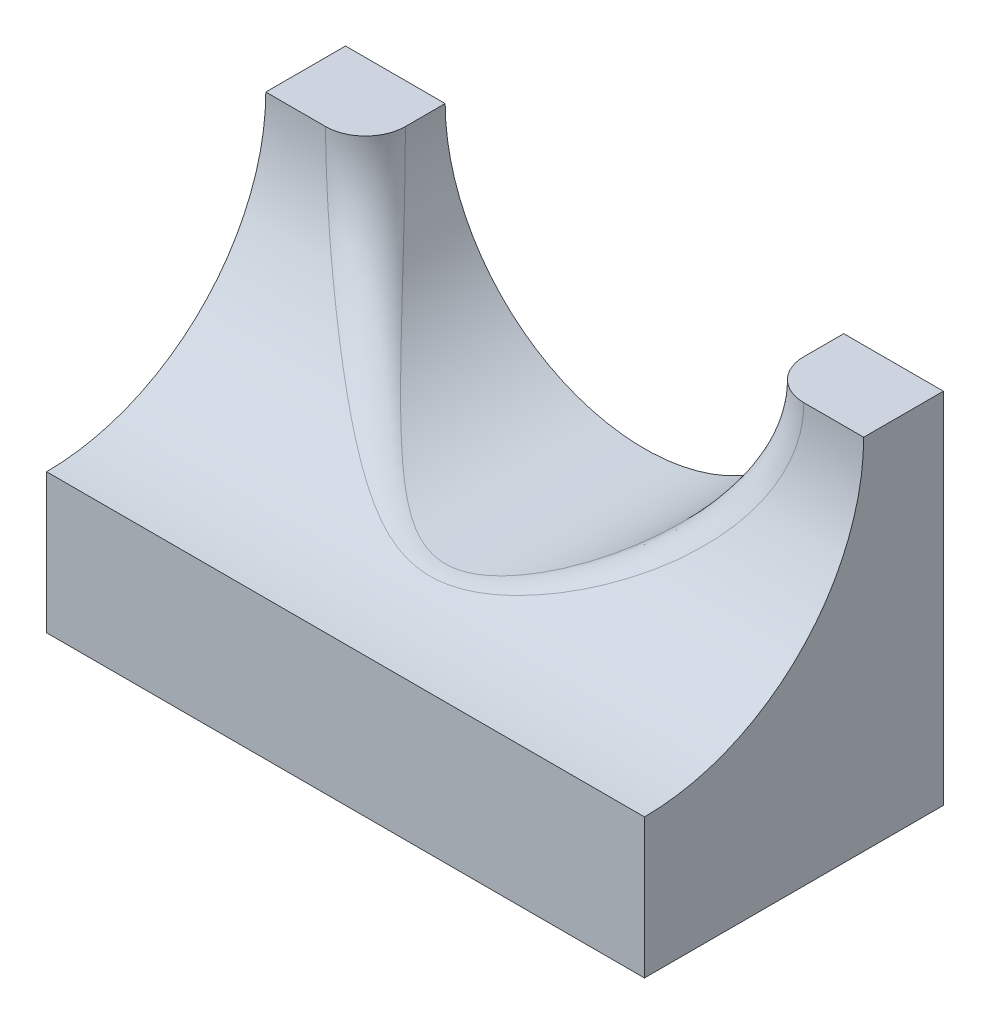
ISO-10303-21;
HEADER;
FILE_DESCRIPTION(('STEP AP214'),'2;1');
FILE_NAME('part.step','',(''),(''),'','','');
FILE_SCHEMA(('AUTOMOTIVE_DESIGN { 1 0 10303 214 1 1 1 1 }'));
ENDSEC;
DATA;
#1=APPLICATION_CONTEXT('core data for automotive mechanical design processes');
#2=APPLICATION_PROTOCOL_DEFINITION('international standard','automotive_design',2000,#1);
#3=PRODUCT_CONTEXT('',#1,'mechanical');
#4=PRODUCT('Part','Part','',(#3));
#5=PRODUCT_RELATED_PRODUCT_CATEGORY('part','',(#4));
#6=PRODUCT_DEFINITION_FORMATION('','',#4);
#7=PRODUCT_DEFINITION_CONTEXT('part definition',#1,'design');
#8=PRODUCT_DEFINITION('design','',#6,#7);
#9=PRODUCT_DEFINITION_SHAPE('','',#8);
#10=(LENGTH_UNIT() NAMED_UNIT(*) SI_UNIT(.MILLI.,.METRE.));
#11=(NAMED_UNIT(*) PLANE_ANGLE_UNIT() SI_UNIT($,.RADIAN.));
#12=(NAMED_UNIT(*) SI_UNIT($,.STERADIAN.) SOLID_ANGLE_UNIT());
#13=UNCERTAINTY_MEASURE_WITH_UNIT(LENGTH_MEASURE(1.E-05),#10,'distance_accuracy_value','');
#14=(GEOMETRIC_REPRESENTATION_CONTEXT(3) GLOBAL_UNCERTAINTY_ASSIGNED_CONTEXT((#13)) GLOBAL_UNIT_ASSIGNED_CONTEXT((#10,
#11,#12)) REPRESENTATION_CONTEXT('',''));
#15=CARTESIAN_POINT('',(0.,0.,0.));
#16=DIRECTION('',(0.,0.,1.));
#17=DIRECTION('',(1.,0.,0.));
#18=AXIS2_PLACEMENT_3D('',#15,#16,#17);
#19=CARTESIAN_POINT('',(95.25,57.15,0.));
#20=DIRECTION('',(0.,-1.,0.));
#21=DIRECTION('',(0.,0.,-1.));
#22=AXIS2_PLACEMENT_3D('',#19,#20,#21);
#23=PLANE('',#22);
#24=DIRECTION('',(1.,0.,0.));
#25=VECTOR('',#24,1.);
#26=CARTESIAN_POINT('',(0.,57.15,-34.925));
#27=LINE('',#26,#25);
#28=CARTESIAN_POINT('',(0.,57.15,-34.925));
#29=VERTEX_POINT('',#28);
#30=CARTESIAN_POINT('',(9.525,57.15,-34.925));
#31=VERTEX_POINT('',#30);
#32=EDGE_CURVE('E160',#29,#31,#27,.T.);
#33=ORIENTED_EDGE('',*,*,#32,.T.);
#34=CARTESIAN_POINT('',(9.525,57.15,-41.275));
#35=DIRECTION('',(0.,-1.,0.));
#36=DIRECTION('',(0.,0.,-1.));
#37=AXIS2_PLACEMENT_3D('',#34,#35,#36);
#38=CIRCLE('',#37,6.35);
#39=CARTESIAN_POINT('',(15.875,57.15,-41.275));
#40=VERTEX_POINT('',#39);
#41=EDGE_CURVE('E51',#31,#40,#38,.F.);
#42=ORIENTED_EDGE('',*,*,#41,.T.);
#43=DIRECTION('',(0.,0.,-1.));
#44=VECTOR('',#43,1.);
#45=CARTESIAN_POINT('',(15.875,57.15,0.));
#46=LINE('',#45,#44);
#47=CARTESIAN_POINT('',(15.875,57.15,-47.625));
#48=VERTEX_POINT('',#47);
#49=EDGE_CURVE('E89',#40,#48,#46,.T.);
#50=ORIENTED_EDGE('',*,*,#49,.T.);
#51=DIRECTION('',(-1.,0.,0.));
#52=VECTOR('',#51,1.);
#53=CARTESIAN_POINT('',(95.25,57.15,-47.625));
#54=LINE('',#53,#52);
#55=CARTESIAN_POINT('',(0.,57.15,-47.625));
#56=VERTEX_POINT('',#55);
#57=EDGE_CURVE('E93',#48,#56,#54,.T.);
#58=ORIENTED_EDGE('',*,*,#57,.T.);
#59=DIRECTION('',(0.,0.,1.));
#60=VECTOR('',#59,1.);
#61=CARTESIAN_POINT('',(0.,57.15,0.));
#62=LINE('',#61,#60);
#63=EDGE_CURVE('E170',#56,#29,#62,.T.);
#64=ORIENTED_EDGE('',*,*,#63,.T.);
#65=EDGE_LOOP('',(#33,#42,#50,#58,#64));
#66=FACE_BOUND('',#65,.T.);
#67=ADVANCED_FACE('F28',(#66),#23,.F.);
#68=CARTESIAN_POINT('',(95.25,0.,0.));
#69=DIRECTION('',(0.,0.,-1.));
#70=DIRECTION('',(-1.,0.,0.));
#71=AXIS2_PLACEMENT_3D('',#68,#69,#70);
#72=PLANE('',#71);
#73=DIRECTION('',(0.,-1.,0.));
#74=VECTOR('',#73,1.);
#75=CARTESIAN_POINT('',(95.25,0.,0.));
#76=LINE('',#75,#74);
#77=CARTESIAN_POINT('',(95.25,22.225,0.));
#78=VERTEX_POINT('',#77);
#79=CARTESIAN_POINT('',(95.25,0.,0.));
#80=VERTEX_POINT('',#79);
#81=EDGE_CURVE('E172',#78,#80,#76,.T.);
#82=ORIENTED_EDGE('',*,*,#81,.F.);
#83=DIRECTION('',(1.,0.,0.));
#84=VECTOR('',#83,1.);
#85=CARTESIAN_POINT('',(0.,22.225,0.));
#86=LINE('',#85,#84);
#87=CARTESIAN_POINT('',(0.,22.225,0.));
#88=VERTEX_POINT('',#87);
#89=EDGE_CURVE('E162',#78,#88,#86,.F.);
#90=ORIENTED_EDGE('',*,*,#89,.T.);
#91=DIRECTION('',(0.,-1.,0.));
#92=VECTOR('',#91,1.);
#93=CARTESIAN_POINT('',(0.,0.,0.));
#94=LINE('',#93,#92);
#95=CARTESIAN_POINT('',(0.,0.,0.));
#96=VERTEX_POINT('',#95);
#97=EDGE_CURVE('E165',#88,#96,#94,.T.);
#98=ORIENTED_EDGE('',*,*,#97,.T.);
#99=DIRECTION('',(-1.,0.,0.));
#100=VECTOR('',#99,1.);
#101=CARTESIAN_POINT('',(95.25,0.,0.));
#102=LINE('',#101,#100);
#103=EDGE_CURVE('E120',#80,#96,#102,.T.);
#104=ORIENTED_EDGE('',*,*,#103,.F.);
#105=EDGE_LOOP('',(#82,#90,#98,#104));
#106=FACE_BOUND('',#105,.T.);
#107=ADVANCED_FACE('F138',(#106),#72,.F.);
#108=CARTESIAN_POINT('',(95.25,0.,0.));
#109=DIRECTION('',(0.,1.,0.));
#110=DIRECTION('',(0.,0.,1.));
#111=AXIS2_PLACEMENT_3D('',#108,#109,#110);
#112=PLANE('',#111);
#113=DIRECTION('',(0.,0.,-1.));
#114=VECTOR('',#113,1.);
#115=CARTESIAN_POINT('',(0.,0.,0.));
#116=LINE('',#115,#114);
#117=CARTESIAN_POINT('',(0.,0.,-47.625));
#118=VERTEX_POINT('',#117);
#119=EDGE_CURVE('E167',#96,#118,#116,.T.);
#120=ORIENTED_EDGE('',*,*,#119,.T.);
#121=DIRECTION('',(-1.,0.,0.));
#122=VECTOR('',#121,1.);
#123=CARTESIAN_POINT('',(95.25,0.,-47.625));
#124=LINE('',#123,#122);
#125=CARTESIAN_POINT('',(95.25,0.,-47.625));
#126=VERTEX_POINT('',#125);
#127=EDGE_CURVE('E113',#126,#118,#124,.T.);
#128=ORIENTED_EDGE('',*,*,#127,.F.);
#129=DIRECTION('',(0.,0.,-1.));
#130=VECTOR('',#129,1.);
#131=CARTESIAN_POINT('',(95.25,0.,0.));
#132=LINE('',#131,#130);
#133=EDGE_CURVE('E174',#80,#126,#132,.T.);
#134=ORIENTED_EDGE('',*,*,#133,.F.);
#135=ORIENTED_EDGE('',*,*,#103,.T.);
#136=EDGE_LOOP('',(#120,#128,#134,#135));
#137=FACE_BOUND('',#136,.T.);
#138=ADVANCED_FACE('F194',(#137),#112,.F.);
#139=CARTESIAN_POINT('',(95.25,0.,-47.625));
#140=DIRECTION('',(0.,0.,1.));
#141=DIRECTION('',(1.,0.,0.));
#142=AXIS2_PLACEMENT_3D('',#139,#140,#141);
#143=PLANE('',#142);
#144=ORIENTED_EDGE('',*,*,#57,.F.);
#145=CARTESIAN_POINT('',(47.625,57.15,-47.625));
#146=DIRECTION('',(0.,0.,-1.));
#147=DIRECTION('',(-1.,0.,0.));
#148=AXIS2_PLACEMENT_3D('',#145,#146,#147);
#149=CIRCLE('',#148,31.75);
#150=CARTESIAN_POINT('',(79.375,57.15,-47.625));
#151=VERTEX_POINT('',#150);
#152=EDGE_CURVE('E99',#151,#48,#149,.T.);
#153=ORIENTED_EDGE('',*,*,#152,.F.);
#154=CARTESIAN_POINT('',(95.25,57.15,-47.625));
#155=VERTEX_POINT('',#154);
#156=EDGE_CURVE('E110',#155,#151,#54,.T.);
#157=ORIENTED_EDGE('',*,*,#156,.F.);
#158=DIRECTION('',(0.,1.,0.));
#159=VECTOR('',#158,1.);
#160=CARTESIAN_POINT('',(95.25,0.,-47.625));
#161=LINE('',#160,#159);
#162=EDGE_CURVE('E115',#126,#155,#161,.T.);
#163=ORIENTED_EDGE('',*,*,#162,.F.);
#164=ORIENTED_EDGE('',*,*,#127,.T.);
#165=DIRECTION('',(0.,1.,0.));
#166=VECTOR('',#165,1.);
#167=CARTESIAN_POINT('',(0.,0.,-47.625));
#168=LINE('',#167,#166);
#169=EDGE_CURVE('E108',#118,#56,#168,.T.);
#170=ORIENTED_EDGE('',*,*,#169,.T.);
#171=EDGE_LOOP('',(#144,#153,#157,#163,#164,#170));
#172=FACE_BOUND('',#171,.T.);
#173=ADVANCED_FACE('F105',(#172),#143,.F.);
#174=DIRECTION('',(0.,0.,-1.));
#175=VECTOR('',#174,1.);
#176=CARTESIAN_POINT('',(79.375,57.15,0.));
#177=LINE('',#176,#175);
#178=CARTESIAN_POINT('',(79.375,57.15,-41.275));
#179=VERTEX_POINT('',#178);
#180=EDGE_CURVE('E96',#151,#179,#177,.F.);
#181=ORIENTED_EDGE('',*,*,#180,.T.);
#182=CARTESIAN_POINT('',(85.725,57.15,-41.275));
#183=DIRECTION('',(0.,-1.,0.));
#184=DIRECTION('',(0.,0.,-1.));
#185=AXIS2_PLACEMENT_3D('',#182,#183,#184);
#186=CIRCLE('',#185,6.35);
#187=CARTESIAN_POINT('',(85.725,57.15,-34.925));
#188=VERTEX_POINT('',#187);
#189=EDGE_CURVE('E11',#179,#188,#186,.F.);
#190=ORIENTED_EDGE('',*,*,#189,.T.);
#191=CARTESIAN_POINT('',(95.25,57.15,-34.925));
#192=VERTEX_POINT('',#191);
#193=EDGE_CURVE('E159',#188,#192,#27,.T.);
#194=ORIENTED_EDGE('',*,*,#193,.T.);
#195=DIRECTION('',(0.,0.,1.));
#196=VECTOR('',#195,1.);
#197=CARTESIAN_POINT('',(95.25,57.15,0.));
#198=LINE('',#197,#196);
#199=EDGE_CURVE('E111',#155,#192,#198,.T.);
#200=ORIENTED_EDGE('',*,*,#199,.F.);
#201=ORIENTED_EDGE('',*,*,#156,.T.);
#202=EDGE_LOOP('',(#181,#190,#194,#200,#201));
#203=FACE_BOUND('',#202,.T.);
#204=ADVANCED_FACE('F183',(#203),#23,.F.);
#205=CARTESIAN_POINT('',(95.25,57.15,0.));
#206=DIRECTION('',(-1.,0.,0.));
#207=DIRECTION('',(0.,0.,1.));
#208=AXIS2_PLACEMENT_3D('',#205,#206,#207);
#209=PLANE('',#208);
#210=ORIENTED_EDGE('',*,*,#199,.T.);
#211=CARTESIAN_POINT('',(95.25,57.15,0.));
#212=DIRECTION('',(1.,0.,0.));
#213=DIRECTION('',(0.,0.,-1.));
#214=AXIS2_PLACEMENT_3D('',#211,#212,#213);
#215=CIRCLE('',#214,34.925);
#216=EDGE_CURVE('E95',#78,#192,#215,.T.);
#217=ORIENTED_EDGE('',*,*,#216,.F.);
#218=ORIENTED_EDGE('',*,*,#81,.T.);
#219=ORIENTED_EDGE('',*,*,#133,.T.);
#220=ORIENTED_EDGE('',*,*,#162,.T.);
#221=EDGE_LOOP('',(#210,#217,#218,#219,#220));
#222=FACE_BOUND('',#221,.T.);
#223=ADVANCED_FACE('F177',(#222),#209,.F.);
#224=CARTESIAN_POINT('',(0.,57.15,0.));
#225=DIRECTION('',(-1.,0.,0.));
#226=DIRECTION('',(0.,0.,1.));
#227=AXIS2_PLACEMENT_3D('',#224,#225,#226);
#228=PLANE('',#227);
#229=CARTESIAN_POINT('',(0.,57.15,0.));
#230=DIRECTION('',(-1.,0.,0.));
#231=DIRECTION('',(0.,0.,1.));
#232=AXIS2_PLACEMENT_3D('',#229,#230,#231);
#233=CIRCLE('',#232,34.925);
#234=EDGE_CURVE('E123',#29,#88,#233,.T.);
#235=ORIENTED_EDGE('',*,*,#234,.F.);
#236=ORIENTED_EDGE('',*,*,#63,.F.);
#237=ORIENTED_EDGE('',*,*,#169,.F.);
#238=ORIENTED_EDGE('',*,*,#119,.F.);
#239=ORIENTED_EDGE('',*,*,#97,.F.);
#240=EDGE_LOOP('',(#235,#236,#237,#238,#239));
#241=FACE_BOUND('',#240,.T.);
#242=ADVANCED_FACE('F197',(#241),#228,.T.);
#243=CARTESIAN_POINT('',(0.,57.15,0.));
#244=DIRECTION('',(1.,0.,0.));
#245=DIRECTION('',(0.,0.,-1.));
#246=AXIS2_PLACEMENT_3D('',#243,#244,#245);
#247=CYLINDRICAL_SURFACE('',#246,34.925);
#248=ORIENTED_EDGE('',*,*,#193,.F.);
#249=CARTESIAN_POINT('',(77.0083944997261,69.1782429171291,-38.6689591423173));
#250=CARTESIAN_POINT('',(77.6958676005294,67.4988377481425,-33.4158302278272));
#251=CARTESIAN_POINT('',(82.8850733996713,69.3632928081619,-32.7198885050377));
#252=CARTESIAN_POINT('',(77.1572633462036,68.8145785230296,-38.8318547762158));
#253=CARTESIAN_POINT('',(77.8119324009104,67.1557996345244,-33.5198149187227));
#254=CARTESIAN_POINT('',(83.0637160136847,68.994033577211,-32.8577232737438));
#255=CARTESIAN_POINT('',(77.3000649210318,68.4464699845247,-38.9883172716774));
#256=CARTESIAN_POINT('',(77.921170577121,66.8132588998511,-33.6177664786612));
#257=CARTESIAN_POINT('',(83.2350779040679,68.6202618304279,-32.9901146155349));
#258=CARTESIAN_POINT('',(77.5729644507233,67.7017420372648,-39.2876471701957));
#259=CARTESIAN_POINT('',(78.1272506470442,66.1269324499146,-33.8026721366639));
#260=CARTESIAN_POINT('',(83.5625573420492,67.8640765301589,-33.2433937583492));
#261=CARTESIAN_POINT('',(77.7030605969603,67.3251214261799,-39.4305126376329));
#262=CARTESIAN_POINT('',(78.2239583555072,65.7832999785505,-33.8895067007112));
#263=CARTESIAN_POINT('',(83.718672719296,67.4816617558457,-33.3642799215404));
#264=CARTESIAN_POINT('',(78.0735958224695,66.1825370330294,-39.8377946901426));
#265=CARTESIAN_POINT('',(78.4967323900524,64.7476952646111,-34.1345455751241));
#266=CARTESIAN_POINT('',(84.1633149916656,66.3214991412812,-33.7089031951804));
#267=CARTESIAN_POINT('',(78.2940144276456,65.4044999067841,-40.080604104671));
#268=CARTESIAN_POINT('',(78.6527731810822,64.0592506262,-34.2748840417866));
#269=CARTESIAN_POINT('',(84.4278173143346,65.5314922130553,-33.914357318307));
#270=CARTESIAN_POINT('',(78.6762823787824,63.8238277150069,-40.5022188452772));
#271=CARTESIAN_POINT('',(78.9180721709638,62.6847171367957,-34.5135804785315));
#272=CARTESIAN_POINT('',(84.886538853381,63.9265019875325,-34.2711082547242));
#273=CARTESIAN_POINT('',(78.8382377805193,63.0212400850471,-40.6811400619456));
#274=CARTESIAN_POINT('',(79.0265648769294,62.0005495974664,-34.6112506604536));
#275=CARTESIAN_POINT('',(85.0808853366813,63.1115668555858,-34.4225031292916));
#276=CARTESIAN_POINT('',(79.0347306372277,61.8040770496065,-40.8983768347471));
#277=CARTESIAN_POINT('',(79.1561984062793,60.9782353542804,-34.7279674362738));
#278=CARTESIAN_POINT('',(85.316676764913,61.8756782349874,-34.6063188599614));
#279=CARTESIAN_POINT('',(79.0924811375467,61.3962273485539,-40.9622570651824));
#280=CARTESIAN_POINT('',(79.19388912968,60.6376775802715,-34.7619057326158));
#281=CARTESIAN_POINT('',(85.3859773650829,61.4615539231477,-34.660371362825));
#282=CARTESIAN_POINT('',(79.1922229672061,60.5768475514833,-41.0726193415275));
#283=CARTESIAN_POINT('',(79.2585649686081,59.9571105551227,-34.8201449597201));
#284=CARTESIAN_POINT('',(85.5056675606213,60.6295682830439,-34.7537548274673));
#285=CARTESIAN_POINT('',(79.2342096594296,60.1653164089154,-41.119096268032));
#286=CARTESIAN_POINT('',(79.2854880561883,59.6174016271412,-34.8443900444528));
#287=CARTESIAN_POINT('',(85.5560515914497,60.2117058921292,-34.7930814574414));
#288=CARTESIAN_POINT('',(79.3265749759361,59.0421654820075,-41.2213566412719));
#289=CARTESIAN_POINT('',(79.344569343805,58.6930020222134,-34.8975950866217));
#290=CARTESIAN_POINT('',(85.6668899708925,59.0712757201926,-34.8796094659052));
#291=CARTESIAN_POINT('',(79.3611907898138,58.3280393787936,-41.2597038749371));
#292=CARTESIAN_POINT('',(79.3662873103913,58.1105920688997,-34.9171536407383));
#293=CARTESIAN_POINT('',(85.7084289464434,58.3461630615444,-34.9120571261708));
#294=CARTESIAN_POINT('',(79.3820490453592,56.8985108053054,-41.2828080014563));
#295=CARTESIAN_POINT('',(79.3794516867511,56.9446193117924,-34.9290090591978));
#296=CARTESIAN_POINT('',(85.7334588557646,56.8946417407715,-34.9316067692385));
#297=CARTESIAN_POINT('',(79.3682953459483,56.1831084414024,-41.2675691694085));
#298=CARTESIAN_POINT('',(79.3708636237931,56.3626979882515,-34.9212748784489));
#299=CARTESIAN_POINT('',(85.7169544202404,56.1682331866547,-34.9187123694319));
#300=CARTESIAN_POINT('',(79.3116807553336,55.1143145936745,-41.2048714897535));
#301=CARTESIAN_POINT('',(79.3349185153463,55.4875724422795,-34.8889042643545));
#302=CARTESIAN_POINT('',(85.6490169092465,55.0829963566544,-34.8656604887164));
#303=CARTESIAN_POINT('',(79.2868408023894,54.7590069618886,-41.1773643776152));
#304=CARTESIAN_POINT('',(79.3191442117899,55.1962299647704,-34.8746986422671));
#305=CARTESIAN_POINT('',(85.6192089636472,54.7222224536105,-34.8423852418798));
#306=CARTESIAN_POINT('',(79.225338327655,54.0503927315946,-41.1092764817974));
#307=CARTESIAN_POINT('',(79.2797893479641,54.6128610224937,-34.8392582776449));
#308=CARTESIAN_POINT('',(85.5454059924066,54.0027064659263,-34.784772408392));
#309=CARTESIAN_POINT('',(79.1886791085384,53.6970856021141,-41.0686993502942));
#310=CARTESIAN_POINT('',(79.2562379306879,54.3210314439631,-34.8180497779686));
#311=CARTESIAN_POINT('',(85.5014149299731,53.6439638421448,-34.7504379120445));
#312=CARTESIAN_POINT('',(79.0611922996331,52.6410395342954,-40.9276343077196));
#313=CARTESIAN_POINT('',(79.173718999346,53.4451736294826,-34.7437424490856));
#314=CARTESIAN_POINT('',(85.3484307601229,52.5716709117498,-34.6310751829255));
#315=CARTESIAN_POINT('',(78.9528495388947,51.942063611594,-40.8078060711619));
#316=CARTESIAN_POINT('',(79.1029127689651,52.8597093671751,-34.6799851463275));
#317=CARTESIAN_POINT('',(85.218419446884,51.8619415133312,-34.5296820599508));
#318=CARTESIAN_POINT('',(78.7010982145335,50.6106002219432,-40.5296782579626));
#319=CARTESIAN_POINT('',(78.933831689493,51.7272872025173,-34.5277782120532));
#320=CARTESIAN_POINT('',(84.9163178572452,50.5099940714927,-34.2943431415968));
#321=CARTESIAN_POINT('',(78.5608450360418,49.9769967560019,-40.3748456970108));
#322=CARTESIAN_POINT('',(78.8383606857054,51.1820720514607,-34.4418499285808));
#323=CARTESIAN_POINT('',(84.7480140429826,49.8666428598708,-34.1633309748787));
#324=CARTESIAN_POINT('',(78.2440595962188,48.7267307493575,-40.0255992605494));
#325=CARTESIAN_POINT('',(78.616848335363,50.0891819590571,-34.2425822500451));
#326=CARTESIAN_POINT('',(84.367871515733,48.5971419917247,-33.8678147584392));
#327=CARTESIAN_POINT('',(78.0675301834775,48.1100668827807,-39.8311884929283));
#328=CARTESIAN_POINT('',(78.4912524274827,49.5424495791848,-34.1296428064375));
#329=CARTESIAN_POINT('',(84.1560362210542,47.9709909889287,-33.7033133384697));
#330=CARTESIAN_POINT('',(77.6803634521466,46.8960256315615,-39.4055169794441));
#331=CARTESIAN_POINT('',(78.2081722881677,48.4482802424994,-33.8753103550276));
#332=CARTESIAN_POINT('',(83.6914361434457,46.7382721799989,-33.3431297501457));
#333=CARTESIAN_POINT('',(77.4696967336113,46.2986654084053,-39.1742244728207));
#334=CARTESIAN_POINT('',(78.0511666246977,47.901598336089,-33.7343455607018));
#335=CARTESIAN_POINT('',(83.4386360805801,46.1317217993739,-33.1474207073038));
#336=CARTESIAN_POINT('',(77.016834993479,45.1259480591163,-38.6780364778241));
#337=CARTESIAN_POINT('',(77.7046535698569,46.8109378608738,-33.4236397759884));
#338=CARTESIAN_POINT('',(82.8952019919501,44.9409626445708,-32.727569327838));
#339=CARTESIAN_POINT('',(76.7746336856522,44.5505953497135,-38.4131342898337));
#340=CARTESIAN_POINT('',(77.5156788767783,46.2675175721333,-33.2543725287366));
#341=CARTESIAN_POINT('',(82.6045604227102,44.3567583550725,-32.5034213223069));
#342=CARTESIAN_POINT('',(76.1618849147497,43.2056145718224,-37.7445808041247));
#343=CARTESIAN_POINT('',(77.026767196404,44.9805478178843,-32.8172191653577));
#344=CARTESIAN_POINT('',(81.8692618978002,42.9910855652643,-31.9377222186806));
#345=CARTESIAN_POINT('',(75.7779238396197,42.4468958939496,-37.3268876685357));
#346=CARTESIAN_POINT('',(76.7118866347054,44.2376479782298,-32.5362308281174));
#347=CARTESIAN_POINT('',(81.4085086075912,42.2206942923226,-31.5842895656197));
#348=CARTESIAN_POINT('',(74.9605471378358,40.9778779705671,-36.4415330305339));
#349=CARTESIAN_POINT('',(76.0204703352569,42.7724040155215,-31.9214505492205));
#350=CARTESIAN_POINT('',(80.4276565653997,40.7290760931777,-30.8351433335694));
#351=CARTESIAN_POINT('',(74.5271159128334,40.2675941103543,-35.9738557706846));
#352=CARTESIAN_POINT('',(75.6452385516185,42.050335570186,-31.5887848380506));
#353=CARTESIAN_POINT('',(79.9075390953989,40.0078647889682,-30.4394164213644));
#354=CARTESIAN_POINT('',(73.615801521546,38.8956831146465,-34.9958133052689));
#355=CARTESIAN_POINT('',(74.8356332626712,40.6340708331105,-30.8744888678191));
#356=CARTESIAN_POINT('',(78.8139618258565,38.6148474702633,-29.6118420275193));
#357=CARTESIAN_POINT('',(73.137841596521,38.2341436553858,-34.4853745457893));
#358=CARTESIAN_POINT('',(74.4022612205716,39.9396281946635,-30.4936932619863));
#359=CARTESIAN_POINT('',(78.2404099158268,37.9431304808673,-29.1799323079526));
#360=CARTESIAN_POINT('',(72.1430961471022,36.9614413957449,-33.4301532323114));
#361=CARTESIAN_POINT('',(73.4809754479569,38.5868568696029,-29.6893033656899));
#362=CARTESIAN_POINT('',(77.0467153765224,36.6508481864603,-28.2870527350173));
#363=CARTESIAN_POINT('',(71.6263106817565,36.350278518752,-32.8853707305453));
#364=CARTESIAN_POINT('',(72.9939124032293,37.927848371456,-29.2663717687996));
#365=CARTESIAN_POINT('',(76.4265728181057,36.0302828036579,-27.8260829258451));
#366=CARTESIAN_POINT('',(70.3836464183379,34.9866739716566,-31.5863471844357));
#367=CARTESIAN_POINT('',(71.8053992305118,36.4467282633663,-28.2427241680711));
#368=CARTESIAN_POINT('',(74.9353757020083,34.6456997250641,-26.7269091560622));
#369=CARTESIAN_POINT('',(69.6445291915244,34.2531356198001,-30.8217246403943));
#370=CARTESIAN_POINT('',(71.0828440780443,35.6344105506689,-27.6262114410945));
#371=CARTESIAN_POINT('',(74.0484350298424,33.9008761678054,-26.0799208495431));
#372=CARTESIAN_POINT('',(68.1114919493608,32.8717844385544,-29.2598826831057));
#373=CARTESIAN_POINT('',(69.5575299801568,34.0910596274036,-26.3444932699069));
#374=CARTESIAN_POINT('',(72.2087903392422,32.4982734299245,-24.7583622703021));
#375=CARTESIAN_POINT('',(67.3175459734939,32.2240126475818,-28.4626479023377));
#376=CARTESIAN_POINT('',(68.7552819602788,33.3574683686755,-25.6793631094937));
#377=CARTESIAN_POINT('',(71.2560551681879,31.8405359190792,-24.0837789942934));
#378=CARTESIAN_POINT('',(66.0886023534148,31.3155840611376,-27.2550807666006));
#379=CARTESIAN_POINT('',(67.4917229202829,32.3179217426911,-24.654463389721));
#380=CARTESIAN_POINT('',(69.7813228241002,30.9181315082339,-23.0619914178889));
#381=CARTESIAN_POINT('',(65.672617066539,31.0233127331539,-26.8506059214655));
#382=CARTESIAN_POINT('',(67.0632857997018,31.9833429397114,-24.3104551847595));
#383=CARTESIAN_POINT('',(69.2821404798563,30.621363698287,-22.7197434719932));
#384=CARTESIAN_POINT('',(64.827908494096,30.459545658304,-26.0399022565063));
#385=CARTESIAN_POINT('',(66.1885100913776,31.3359965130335,-23.6171622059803));
#386=CARTESIAN_POINT('',(68.2684901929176,30.048923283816,-22.0337634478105));
#387=CARTESIAN_POINT('',(64.399185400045,30.1880495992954,-25.6336734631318));
#388=CARTESIAN_POINT('',(65.7421240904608,31.0229039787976,-23.2677661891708));
#389=CARTESIAN_POINT('',(67.7540224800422,29.7732503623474,-21.6900313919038));
#390=CARTESIAN_POINT('',(63.5290930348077,29.6658291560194,-24.8221996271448));
#391=CARTESIAN_POINT('',(64.8318617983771,30.4191373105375,-22.5665163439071));
#392=CARTESIAN_POINT('',(66.709911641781,29.2429957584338,-21.0033996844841));
#393=CARTESIAN_POINT('',(63.0877304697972,29.4150940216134,-24.4169541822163));
#394=CARTESIAN_POINT('',(64.3679161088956,30.1281378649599,-22.2145186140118));
#395=CARTESIAN_POINT('',(66.1802765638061,28.9884031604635,-20.6604996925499));
#396=CARTESIAN_POINT('',(62.1916688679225,28.9341671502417,-23.6101615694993));
#397=CARTESIAN_POINT('',(63.4221352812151,29.568804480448,-21.5109116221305));
#398=CARTESIAN_POINT('',(65.105002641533,28.5000774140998,-19.9778290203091));
#399=CARTESIAN_POINT('',(61.7369700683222,28.7039750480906,-23.208614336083));
#400=CARTESIAN_POINT('',(62.94019069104,29.3001683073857,-21.1591230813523));
#401=CARTESIAN_POINT('',(64.5593640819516,28.2663438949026,-19.6380582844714));
#402=CARTESIAN_POINT('',(60.7879209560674,28.2520529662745,-22.3907975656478));
#403=CARTESIAN_POINT('',(61.9309043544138,28.7719620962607,-20.440333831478));
#404=CARTESIAN_POINT('',(63.4205051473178,27.8074691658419,-18.9460594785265));
#405=CARTESIAN_POINT('',(60.2927670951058,28.0314906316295,-21.9749381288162));
#406=CARTESIAN_POINT('',(61.4021734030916,28.5132806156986,-20.073186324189));
#407=CARTESIAN_POINT('',(62.8263205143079,27.5835135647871,-18.5941784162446));
#408=CARTESIAN_POINT('',(59.2853248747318,27.6136379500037,-21.1566654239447));
#409=CARTESIAN_POINT('',(60.3230324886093,28.0225349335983,-19.3486310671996));
#410=CARTESIAN_POINT('',(61.617389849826,27.1592323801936,-17.9017938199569));
#411=CARTESIAN_POINT('',(58.7730400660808,27.4163428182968,-20.754249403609));
#412=CARTESIAN_POINT('',(59.7724295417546,27.7901479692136,-18.9909372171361));
#413=CARTESIAN_POINT('',(61.0026480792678,26.9589019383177,-17.5612879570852));
#414=CARTESIAN_POINT('',(57.7293245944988,27.0456508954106,-19.9699108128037));
#415=CARTESIAN_POINT('',(58.6477120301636,27.353077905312,-18.2921208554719));
#416=CARTESIAN_POINT('',(59.7501895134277,26.5825070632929,-16.8976168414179));
#417=CARTESIAN_POINT('',(57.1978970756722,26.8722502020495,-19.5879849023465));
#418=CARTESIAN_POINT('',(58.0733626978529,27.1480931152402,-17.950674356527));
#419=CARTESIAN_POINT('',(59.112476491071,26.4064386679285,-16.5744487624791));
#420=CARTESIAN_POINT('',(56.1134181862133,26.5505053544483,-18.8542639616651));
#421=CARTESIAN_POINT('',(56.8987996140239,26.7674874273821,-17.2935399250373));
#422=CARTESIAN_POINT('',(57.8111018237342,26.0797438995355,-15.9536079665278));
#423=CARTESIAN_POINT('',(55.560373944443,26.4021530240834,-18.5024591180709));
#424=CARTESIAN_POINT('',(56.2983047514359,26.5915809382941,-16.9774874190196));
#425=CARTESIAN_POINT('',(57.1474487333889,25.9291092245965,-15.655926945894));
#426=CARTESIAN_POINT('',(54.5952655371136,26.171832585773,-17.9388439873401));
#427=CARTESIAN_POINT('',(55.2480582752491,26.3182295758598,-16.4702356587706));
#428=CARTESIAN_POINT('',(55.9893186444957,25.6952453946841,-15.1790218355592));
#429=CARTESIAN_POINT('',(54.1892300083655,26.0831338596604,-17.7161659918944));
#430=CARTESIAN_POINT('',(54.8058200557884,26.2128830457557,-16.2695866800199));
#431=CARTESIAN_POINT('',(55.5020760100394,25.6051820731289,-14.9906019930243));
#432=CARTESIAN_POINT('',(53.3642614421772,25.9202041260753,-17.2987422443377));
#433=CARTESIAN_POINT('',(53.9064325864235,26.0193280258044,-15.893188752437));
#434=CARTESIAN_POINT('',(54.5121137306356,25.4397457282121,-14.6373972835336));
#435=CARTESIAN_POINT('',(52.9453263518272,25.8459754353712,-17.1040009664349));
#436=CARTESIAN_POINT('',(53.4491254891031,25.9310388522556,-15.717302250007));
#437=CARTESIAN_POINT('',(54.0093916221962,25.3643750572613,-14.4726162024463));
#438=CARTESIAN_POINT('',(52.0964554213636,25.7135192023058,-16.7505148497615));
#439=CARTESIAN_POINT('',(52.5218382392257,25.7734841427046,-15.3979032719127));
#440=CARTESIAN_POINT('',(52.9907465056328,25.2298810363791,-14.1735125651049));
#441=CARTESIAN_POINT('',(51.6665728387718,25.6552261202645,-16.5916230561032));
#442=CARTESIAN_POINT('',(52.0517368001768,25.7040677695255,-15.2541230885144));
#443=CARTESIAN_POINT('',(52.4748874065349,25.17069113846,-14.0390656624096));
#444=CARTESIAN_POINT('',(50.7956073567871,25.5556745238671,-16.3168087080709));
#445=CARTESIAN_POINT('',(51.098856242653,25.5855376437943,-15.0054182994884));
#446=CARTESIAN_POINT('',(51.4297288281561,25.0696079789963,-13.8065304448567));
#447=CARTESIAN_POINT('',(50.3545352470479,25.5144002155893,-16.2008463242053));
#448=CARTESIAN_POINT('',(50.6158675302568,25.5363446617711,-14.9003365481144));
#449=CARTESIAN_POINT('',(50.9004422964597,25.0276986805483,-13.7084084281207));
#450=CARTESIAN_POINT('',(49.6792265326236,25.4656824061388,-16.0629370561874));
#451=CARTESIAN_POINT('',(49.8760837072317,25.4782849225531,-14.7753599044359));
#452=CARTESIAN_POINT('',(50.0900718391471,24.9782313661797,-13.5917159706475));
#453=CARTESIAN_POINT('',(49.4480061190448,25.4515280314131,-16.0226351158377));
#454=CARTESIAN_POINT('',(49.6227725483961,25.4614156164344,-14.7388320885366));
#455=CARTESIAN_POINT('',(49.8126073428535,24.9638592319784,-13.5576143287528));
#456=CARTESIAN_POINT('',(48.9837819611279,25.4282368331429,-15.956119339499));
#457=CARTESIAN_POINT('',(49.1141574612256,25.4336585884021,-14.6785458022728));
#458=CARTESIAN_POINT('',(49.2555383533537,24.9402097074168,-13.5013317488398));
#459=CARTESIAN_POINT('',(48.7507773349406,25.4191026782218,-15.9299129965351));
#460=CARTESIAN_POINT('',(48.8588145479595,25.4227698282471,-14.6547850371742));
#461=CARTESIAN_POINT('',(48.9759328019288,24.9309350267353,-13.4791571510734));
#462=CARTESIAN_POINT('',(48.1148156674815,25.4012296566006,-15.8785874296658));
#463=CARTESIAN_POINT('',(48.1619257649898,25.4014689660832,-14.6082603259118));
#464=CARTESIAN_POINT('',(48.2127788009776,24.9127870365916,-13.4357278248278));
#465=CARTESIAN_POINT('',(47.71081956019,25.3975543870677,-15.8679619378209));
#466=CARTESIAN_POINT('',(47.7190260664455,25.3970853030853,-14.5986199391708));
#467=CARTESIAN_POINT('',(47.7279834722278,24.9090552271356,-13.426737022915));
#468=CARTESIAN_POINT('',(46.9037129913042,25.4056253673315,-15.8911942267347));
#469=CARTESIAN_POINT('',(46.8344508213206,25.4067055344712,-14.6196828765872));
#470=CARTESIAN_POINT('',(46.7594555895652,24.9172503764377,-13.4463951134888));
#471=CARTESIAN_POINT('',(46.5006031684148,25.4173804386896,-15.925077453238));
#472=CARTESIAN_POINT('',(46.3925698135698,25.4207244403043,-14.650419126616));
#473=CARTESIAN_POINT('',(46.2757238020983,24.9291862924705,-13.4750655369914));
#474=CARTESIAN_POINT('',(45.6982061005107,25.4559671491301,-16.0353443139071));
#475=CARTESIAN_POINT('',(45.5134207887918,25.4667105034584,-14.7503613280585));
#476=CARTESIAN_POINT('',(45.3128473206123,24.9683666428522,-13.5683682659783));
#477=CARTESIAN_POINT('',(45.2989308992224,25.4828363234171,-16.1118337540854));
#478=CARTESIAN_POINT('',(45.0759703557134,25.4987433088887,-14.8197082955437));
#479=CARTESIAN_POINT('',(44.8337170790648,24.9956491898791,-13.6330900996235));
#480=CARTESIAN_POINT('',(44.5081383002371,25.5508653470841,-16.3030272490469));
#481=CARTESIAN_POINT('',(44.2101356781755,25.5797812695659,-14.9928752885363));
#482=CARTESIAN_POINT('',(43.8847659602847,25.0647248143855,-13.7948692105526));
#483=CARTESIAN_POINT('',(44.1166213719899,25.5920260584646,-16.4177336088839));
#484=CARTESIAN_POINT('',(43.7815748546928,25.628822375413,-15.096770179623));
#485=CARTESIAN_POINT('',(43.4149456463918,25.106518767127,-13.8919284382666));
#486=CARTESIAN_POINT('',(43.1903544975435,25.7065295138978,-16.7316785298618));
#487=CARTESIAN_POINT('',(42.768214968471,25.7651689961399,-15.3808822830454));
#488=CARTESIAN_POINT('',(42.3034253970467,25.2227838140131,-14.1575741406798));
#489=CARTESIAN_POINT('',(42.6600405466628,25.7861622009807,-16.9464129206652));
#490=CARTESIAN_POINT('',(42.1885343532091,25.8599909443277,-15.5751386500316));
#491=CARTESIAN_POINT('',(41.6670486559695,25.3036416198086,-14.3392724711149));
#492=CARTESIAN_POINT('',(41.6191580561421,25.9687219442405,-17.4247772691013));
#493=CARTESIAN_POINT('',(41.0524854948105,26.0770206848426,-16.0069829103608));
#494=CARTESIAN_POINT('',(40.4179896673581,25.4890099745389,-14.7440423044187));
#495=CARTESIAN_POINT('',(41.1086023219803,26.0716638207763,-17.688438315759));
#496=CARTESIAN_POINT('',(40.4958056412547,26.1993965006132,-16.2448671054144));
#497=CARTESIAN_POINT('',(39.8053227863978,25.5935355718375,-14.9671401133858));
#498=CARTESIAN_POINT('',(40.1049747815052,26.2991117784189,-18.2528051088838));
#499=CARTESIAN_POINT('',(39.4034585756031,26.4693099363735,-16.7528938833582));
#500=CARTESIAN_POINT('',(38.6009697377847,25.8244827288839,-15.4446812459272));
#501=CARTESIAN_POINT('',(39.6119651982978,26.4236868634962,-18.5536284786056));
#502=CARTESIAN_POINT('',(38.8676086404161,26.617096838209,-17.0234041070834));
#503=CARTESIAN_POINT('',(38.0093582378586,25.9509743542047,-15.6992240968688));
#504=CARTESIAN_POINT('',(38.6432981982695,26.6927456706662,-19.1818302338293));
#505=CARTESIAN_POINT('',(37.816958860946,26.935676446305,-17.5868742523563));
#506=CARTESIAN_POINT('',(36.8469578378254,26.2241725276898,-16.2307794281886));
#507=CARTESIAN_POINT('',(38.1676485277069,26.8372381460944,-19.5092202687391));
#508=CARTESIAN_POINT('',(37.3019551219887,27.1066638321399,-17.8800960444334));
#509=CARTESIAN_POINT('',(36.2761782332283,26.3708879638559,-16.5078017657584));
#510=CARTESIAN_POINT('',(37.2285994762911,27.1462753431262,-20.1854822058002));
#511=CARTESIAN_POINT('',(36.2876255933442,27.4716038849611,-18.4840953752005));
#512=CARTESIAN_POINT('',(35.1493193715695,26.6846795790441,-17.0800234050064));
#513=CARTESIAN_POINT('',(36.7653194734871,27.3109630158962,-20.534497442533));
#514=CARTESIAN_POINT('',(35.7882832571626,27.665914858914,-18.7952140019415));
#515=CARTESIAN_POINT('',(34.5933833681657,26.8519009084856,-17.3753439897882));
#516=CARTESIAN_POINT('',(35.8532517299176,27.6588723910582,-21.2459281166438));
#517=CARTESIAN_POINT('',(34.8079266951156,28.0754411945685,-19.4274110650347));
#518=CARTESIAN_POINT('',(33.4989020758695,27.2051627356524,-17.9773237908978));
#519=CARTESIAN_POINT('',(35.4044618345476,27.8420913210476,-21.6083415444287));
#520=CARTESIAN_POINT('',(34.3267553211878,28.2908681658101,-19.7487021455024));
#521=CARTESIAN_POINT('',(32.9603542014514,27.3912004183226,-18.2839813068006));
#522=CARTESIAN_POINT('',(34.5196594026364,28.2269043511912,-22.3425252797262));
#523=CARTESIAN_POINT('',(33.3810785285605,28.7421526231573,-20.3973160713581));
#524=CARTESIAN_POINT('',(31.8985912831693,27.7819336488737,-18.9052136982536));
#525=CARTESIAN_POINT('',(34.0836582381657,28.4285141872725,-22.7143033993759));
#526=CARTESIAN_POINT('',(32.9164597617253,28.9782539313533,-20.7248333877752));
#527=CARTESIAN_POINT('',(31.3753898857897,27.986645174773,-19.2197951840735));
#528=CARTESIAN_POINT('',(33.2239043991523,28.8498215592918,-23.4634555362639));
#529=CARTESIAN_POINT('',(32.0035240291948,29.470212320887,-21.3822380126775));
#530=CARTESIAN_POINT('',(30.3436852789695,28.4144341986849,-19.8536931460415));
#531=CARTESIAN_POINT('',(32.8001520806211,29.0695196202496,-23.8408297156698));
#532=CARTESIAN_POINT('',(31.5550992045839,29.7263094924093,-21.7122929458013));
#533=CARTESIAN_POINT('',(29.8351824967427,28.6375122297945,-20.1730097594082));
#534=CARTESIAN_POINT('',(31.9637468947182,29.5272700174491,-24.598842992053));
#535=CARTESIAN_POINT('',(30.6735403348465,30.2581841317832,-22.3723896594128));
#536=CARTESIAN_POINT('',(28.8314962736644,29.1023049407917,-20.8144056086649));
#537=CARTESIAN_POINT('',(31.5511088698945,29.7653454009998,-24.9794856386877));
#538=CARTESIAN_POINT('',(30.2403434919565,30.5342355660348,-22.7025718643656));
#539=CARTESIAN_POINT('',(28.3363306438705,29.3440430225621,-21.1364878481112));
#540=CARTESIAN_POINT('',(30.7371436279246,30.259676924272,-25.7412112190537));
#541=CARTESIAN_POINT('',(29.3896819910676,31.1053550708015,-23.3601301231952));
#542=CARTESIAN_POINT('',(27.3595723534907,29.8459796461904,-21.7810248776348));
#543=CARTESIAN_POINT('',(30.335817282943,30.5159344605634,-26.1222941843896));
#544=CARTESIAN_POINT('',(28.9721555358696,31.4006855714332,-23.6876238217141));
#545=CARTESIAN_POINT('',(26.8779807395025,30.1061796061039,-22.1034796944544));
#546=CARTESIAN_POINT('',(29.1489003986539,31.3119604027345,-27.2627599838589));
#547=CARTESIAN_POINT('',(27.738812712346,32.318018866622,-24.6662071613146));
#548=CARTESIAN_POINT('',(25.4536804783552,30.9144521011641,-23.0684892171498));
#549=CARTESIAN_POINT('',(28.3799176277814,31.8792308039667,-28.0197765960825));
#550=CARTESIAN_POINT('',(26.9511670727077,32.9661220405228,-25.3066597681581));
#551=CARTESIAN_POINT('',(24.5309011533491,31.490449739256,-23.7090417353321));
#552=CARTESIAN_POINT('',(26.8373153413,33.1294742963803,-29.5635355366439));
#553=CARTESIAN_POINT('',(25.3902745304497,34.3795242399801,-26.5956650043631));
#554=CARTESIAN_POINT('',(22.6797784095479,32.7599277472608,-25.0152993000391));
#555=CARTESIAN_POINT('',(26.0669115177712,33.8176824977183,-30.3488169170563));
#556=CARTESIAN_POINT('',(24.6227879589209,35.151478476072,-27.2412828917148));
#557=CARTESIAN_POINT('',(21.7552938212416,33.45872376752,-25.6797681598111));
#558=CARTESIAN_POINT('',(24.583265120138,35.2815901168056,-31.8800366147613));
#559=CARTESIAN_POINT('',(23.1698789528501,36.7692162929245,-28.4774894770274));
#560=CARTESIAN_POINT('',(19.9749181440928,34.9451530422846,-26.9754155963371));
#561=CARTESIAN_POINT('',(23.8700404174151,36.0573167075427,-32.6259626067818));
#562=CARTESIAN_POINT('',(22.4853994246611,37.6174865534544,-29.0675926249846));
#563=CARTESIAN_POINT('',(19.1190485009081,35.7328138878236,-27.606583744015));
#564=CARTESIAN_POINT('',(22.5114342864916,37.6949674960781,-34.0596706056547));
#565=CARTESIAN_POINT('',(21.2093141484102,39.3753384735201,-30.1764224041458));
#566=CARTESIAN_POINT('',(17.48872114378,37.3956593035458,-28.8197212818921));
#567=CARTESIAN_POINT('',(21.8658225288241,38.5565781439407,-34.7476483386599));
#568=CARTESIAN_POINT('',(20.6190668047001,40.2866275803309,-30.6941450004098));
#569=CARTESIAN_POINT('',(16.7139870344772,38.2705254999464,-29.401856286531));
#570=CARTESIAN_POINT('',(20.9550777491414,39.9141496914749,-35.7244908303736));
#571=CARTESIAN_POINT('',(19.8123411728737,41.6828034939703,-31.4055364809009));
#572=CARTESIAN_POINT('',(15.6210932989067,39.6489827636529,-30.2284153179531));
#573=CARTESIAN_POINT('',(20.6611752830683,40.377407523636,-36.0408446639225));
#574=CARTESIAN_POINT('',(19.5547754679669,42.1570500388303,-31.6333810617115));
#575=CARTESIAN_POINT('',(15.2684103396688,40.1193676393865,-30.4960993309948));
#576=CARTESIAN_POINT('',(20.0939742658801,41.325640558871,-36.6531321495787));
#577=CARTESIAN_POINT('',(19.0651658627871,43.1163925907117,-32.0675056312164));
#578=CARTESIAN_POINT('',(14.587769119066,41.0821888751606,-31.0141887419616));
#579=CARTESIAN_POINT('',(19.8206797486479,41.8106199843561,-36.9490618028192));
#580=CARTESIAN_POINT('',(18.8334911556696,43.6014780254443,-32.2734707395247));
#581=CARTESIAN_POINT('',(14.2598156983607,41.5746295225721,-31.2645907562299));
#582=CARTESIAN_POINT('',(19.2397403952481,42.9090514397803,-37.5796497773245));
#583=CARTESIAN_POINT('',(18.3484989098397,44.6874376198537,-32.7054357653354));
#584=CARTESIAN_POINT('',(13.5626884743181,42.6899599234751,-31.7981651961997));
#585=CARTESIAN_POINT('',(18.937481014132,43.5275736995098,-37.90880879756));
#586=CARTESIAN_POINT('',(18.1027374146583,45.2888115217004,-32.9249019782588));
#587=CARTESIAN_POINT('',(13.1999772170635,43.3179979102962,-32.0766843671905));
#588=CARTESIAN_POINT('',(18.3696960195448,44.7939878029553,-38.5285927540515));
#589=CARTESIAN_POINT('',(17.6506977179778,46.4995677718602,-33.3292180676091));
#590=CARTESIAN_POINT('',(12.5186352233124,44.60389530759,-32.6011169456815));
#591=CARTESIAN_POINT('',(18.1041588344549,45.4418703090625,-38.8192298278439));
#592=CARTESIAN_POINT('',(17.4451652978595,47.1084192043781,-33.5134099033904));
#593=CARTESIAN_POINT('',(12.1999906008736,45.2617452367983,-32.8470406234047));
#594=CARTESIAN_POINT('',(17.6132849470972,46.764584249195,-39.3575113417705));
#595=CARTESIAN_POINT('',(17.0732966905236,48.3300948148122,-33.8470216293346));
#596=CARTESIAN_POINT('',(11.6109419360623,46.6048086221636,-33.3025095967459));
#597=CARTESIAN_POINT('',(17.387937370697,47.4394083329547,-39.6051674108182));
#598=CARTESIAN_POINT('',(16.907698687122,48.9420734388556,-33.9957839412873));
#599=CARTESIAN_POINT('',(11.3405248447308,47.2900146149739,-33.5120647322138));
#600=CARTESIAN_POINT('',(16.9808096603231,48.8127929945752,-40.0532365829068));
#601=CARTESIAN_POINT('',(16.6145728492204,50.1668182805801,-34.2592741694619));
#602=CARTESIAN_POINT('',(10.8519715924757,48.6845282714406,-33.8912001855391));
#603=CARTESIAN_POINT('',(16.7990310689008,49.5113544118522,-40.2536480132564));
#604=CARTESIAN_POINT('',(16.4877313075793,50.7784281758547,-34.3733871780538));
#605=CARTESIAN_POINT('',(10.6338372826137,49.3938367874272,-34.0607790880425));
#606=CARTESIAN_POINT('',(16.4810455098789,50.9330106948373,-40.6045817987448));
#607=CARTESIAN_POINT('',(16.2696375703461,52.0048542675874,-34.569654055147));
#608=CARTESIAN_POINT('',(10.2522546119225,50.8373647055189,-34.3577230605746));
#609=CARTESIAN_POINT('',(16.3451842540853,51.6562484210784,-40.7547256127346));
#610=CARTESIAN_POINT('',(16.1792396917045,52.6181671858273,-34.6510402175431));
#611=CARTESIAN_POINT('',(10.089221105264,51.5717291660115,-34.4847678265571));
#612=CARTESIAN_POINT('',(16.1235485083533,53.1168169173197,-40.9998126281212));
#613=CARTESIAN_POINT('',(16.0334588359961,53.8429547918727,-34.7823006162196));
#614=CARTESIAN_POINT('',(9.82325820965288,53.0547679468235,-34.6921491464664));
#615=CARTESIAN_POINT('',(16.0377738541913,53.8541476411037,-41.0947560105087));
#616=CARTESIAN_POINT('',(15.9784934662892,54.4527546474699,-34.8317989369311));
#617=CARTESIAN_POINT('',(9.72032862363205,53.8034422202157,-34.7724858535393));
#618=CARTESIAN_POINT('',(15.918164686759,55.3358832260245,-41.227182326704));
#619=CARTESIAN_POINT('',(15.9020937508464,55.6710755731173,-34.9006002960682));
#620=CARTESIAN_POINT('',(9.57679762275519,55.3079737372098,-34.8845388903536));
#621=CARTESIAN_POINT('',(15.8842808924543,56.0802806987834,-41.2647197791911));
#622=CARTESIAN_POINT('',(15.8808560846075,56.2777933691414,-34.919726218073));
#623=CARTESIAN_POINT('',(9.53613707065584,56.0638234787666,-34.9163013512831));
#624=CARTESIAN_POINT('',(15.8690427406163,57.5700344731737,-41.2815986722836));
#625=CARTESIAN_POINT('',(15.8712384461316,57.4927085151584,-34.9283875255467));
#626=CARTESIAN_POINT('',(9.51785128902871,57.5764965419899,-34.9305834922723));
#627=CARTESIAN_POINT('',(15.8876836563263,58.3153906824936,-41.2609453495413));
#628=CARTESIAN_POINT('',(15.8828847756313,58.0990480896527,-34.9178992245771));
#629=CARTESIAN_POINT('',(9.54022038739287,58.3333197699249,-34.9131076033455));
#630=CARTESIAN_POINT('',(15.9723564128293,59.7221270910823,-41.1671796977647));
#631=CARTESIAN_POINT('',(15.9366924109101,59.2516264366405,-34.8694424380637));
#632=CARTESIAN_POINT('',(9.64182769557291,59.7616982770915,-34.8337674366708));
#633=CARTESIAN_POINT('',(16.0332001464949,60.3840979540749,-41.0998105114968));
#634=CARTESIAN_POINT('',(15.9753825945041,59.7959555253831,-34.8345998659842));
#635=CARTESIAN_POINT('',(9.71484017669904,60.4338533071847,-34.7767627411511));
#636=CARTESIAN_POINT('',(16.1955493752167,61.6987028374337,-40.9201799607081));
#637=CARTESIAN_POINT('',(16.0807388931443,60.8884363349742,-34.7397286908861));
#638=CARTESIAN_POINT('',(9.90965924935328,61.7686828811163,-34.6247676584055));
#639=CARTESIAN_POINT('',(16.2970522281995,62.3513374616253,-40.8079215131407));
#640=CARTESIAN_POINT('',(16.147156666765,61.4353471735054,-34.6799236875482));
#641=CARTESIAN_POINT('',(10.0314626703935,62.4313580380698,-34.5297797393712));
#642=CARTESIAN_POINT('',(16.5393158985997,63.6443266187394,-40.5402621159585));
#643=CARTESIAN_POINT('',(16.3096490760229,62.5340142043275,-34.5336458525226));
#644=CARTESIAN_POINT('',(10.3221790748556,63.7442393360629,-34.3032987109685));
#645=CARTESIAN_POINT('',(16.6801521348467,64.2846550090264,-40.3847782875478));
#646=CARTESIAN_POINT('',(16.4054208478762,63.0846537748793,-34.4474455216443));
#647=CARTESIAN_POINT('',(10.4911825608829,64.3944189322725,-34.1717354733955));
#648=CARTESIAN_POINT('',(16.9988811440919,65.5480864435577,-40.0333749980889));
#649=CARTESIAN_POINT('',(16.6281316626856,64.1884950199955,-34.2470966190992));
#650=CARTESIAN_POINT('',(10.8736573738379,65.6772877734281,-33.8743942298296));
#651=CARTESIAN_POINT('',(17.1767735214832,66.1711896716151,-39.8374559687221));
#652=CARTESIAN_POINT('',(16.7546152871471,64.7407230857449,-34.1333569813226));
#653=CARTESIAN_POINT('',(11.0871282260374,66.3099772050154,-33.7086165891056));
#654=CARTESIAN_POINT('',(17.5732069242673,67.4160607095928,-39.4015867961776));
#655=CARTESIAN_POINT('',(17.0443375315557,65.8622755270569,-33.8730538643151));
#656=CARTESIAN_POINT('',(11.5628483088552,67.5740001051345,-33.3398042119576));
#657=CARTESIAN_POINT('',(17.7928295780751,68.037198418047,-39.1604680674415));
#658=CARTESIAN_POINT('',(17.2080698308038,66.4309362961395,-33.726050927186));
#659=CARTESIAN_POINT('',(11.8263954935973,68.2046937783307,-33.1357806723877));
#660=CARTESIAN_POINT('',(18.2661271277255,69.2556351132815,-38.6419556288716));
#661=CARTESIAN_POINT('',(17.5707670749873,67.5653038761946,-33.400859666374));
#662=CARTESIAN_POINT('',(12.3943525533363,69.4418756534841,-32.6970393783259));
#663=CARTESIAN_POINT('',(18.5198099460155,69.8529285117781,-38.3645534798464));
#664=CARTESIAN_POINT('',(17.7691323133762,68.1303888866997,-33.2232045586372));
#665=CARTESIAN_POINT('',(12.6987719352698,70.0483581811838,-32.4623144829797));
#666=CARTESIAN_POINT('',(19.0571055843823,71.0189614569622,-37.7785251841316));
#667=CARTESIAN_POINT('',(18.2001739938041,69.2511272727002,-32.8378889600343));
#668=CARTESIAN_POINT('',(13.3435267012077,71.2323300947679,-31.9664443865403));
#669=CARTESIAN_POINT('',(19.3405740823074,71.5878206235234,-37.4700498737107));
#670=CARTESIAN_POINT('',(18.4320742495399,69.8063979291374,-32.6309112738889));
#671=CARTESIAN_POINT('',(13.6836888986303,71.8099409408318,-31.7054268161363));
#672=CARTESIAN_POINT('',(19.9355414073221,72.698413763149,-36.8245769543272));
#673=CARTESIAN_POINT('',(18.929899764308,70.9057239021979,-32.1877127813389));
#674=CARTESIAN_POINT('',(14.3976496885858,72.9376201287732,-31.1592574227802));
#675=CARTESIAN_POINT('',(20.2470191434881,73.2401676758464,-36.4876008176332));
#676=CARTESIAN_POINT('',(19.1952334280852,71.4496138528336,-31.9520048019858));
#677=CARTESIAN_POINT('',(14.7714229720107,73.4877087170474,-30.8741237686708));
#678=CARTESIAN_POINT('',(20.5712859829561,73.7680341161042,-36.1380212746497));
#679=CARTESIAN_POINT('',(19.4791968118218,71.9901422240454,-31.7004790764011));
#680=CARTESIAN_POINT('',(15.1605431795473,74.0236961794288,-30.5783256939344));
#681=(BOUNDED_SURFACE() B_SPLINE_SURFACE(3,2,((#249,#250,#251),(#252,#253,#254),(#255,#256,
#257),(#258,#259,#260),(#261,#262,#263),(#264,#265,#266),(#267,#268,#269),(#270,#271,#272),
(#273,#274,#275),(#276,#277,#278),(#279,#280,#281),(#282,#283,#284),(#285,#286,#287),(#288,#289,
#290),(#291,#292,#293),(#294,#295,#296),(#297,#298,#299),(#300,#301,#302),(#303,#304,#305),
(#306,#307,#308),(#309,#310,#311),(#312,#313,#314),(#315,#316,#317),(#318,#319,#320),(#321,#322,
#323),(#324,#325,#326),(#327,#328,#329),(#330,#331,#332),(#333,#334,#335),(#336,#337,#338),
(#339,#340,#341),(#342,#343,#344),(#345,#346,#347),(#348,#349,#350),(#351,#352,#353),(#354,#355,
#356),(#357,#358,#359),(#360,#361,#362),(#363,#364,#365),(#366,#367,#368),(#369,#370,#371),
(#372,#373,#374),(#375,#376,#377),(#378,#379,#380),(#381,#382,#383),(#384,#385,#386),(#387,#388,
#389),(#390,#391,#392),(#393,#394,#395),(#396,#397,#398),(#399,#400,#401),(#402,#403,#404),
(#405,#406,#407),(#408,#409,#410),(#411,#412,#413),(#414,#415,#416),(#417,#418,#419),(#420,#421,
#422),(#423,#424,#425),(#426,#427,#428),(#429,#430,#431),(#432,#433,#434),(#435,#436,#437),
(#438,#439,#440),(#441,#442,#443),(#444,#445,#446),(#447,#448,#449),(#450,#451,#452),(#453,#454,
#455),(#456,#457,#458),(#459,#460,#461),(#462,#463,#464),(#465,#466,#467),(#468,#469,#470),
(#471,#472,#473),(#474,#475,#476),(#477,#478,#479),(#480,#481,#482),(#483,#484,#485),(#486,#487,
#488),(#489,#490,#491),(#492,#493,#494),(#495,#496,#497),(#498,#499,#500),(#501,#502,#503),
(#504,#505,#506),(#507,#508,#509),(#510,#511,#512),(#513,#514,#515),(#516,#517,#518),(#519,#520,
#521),(#522,#523,#524),(#525,#526,#527),(#528,#529,#530),(#531,#532,#533),(#534,#535,#536),
(#537,#538,#539),(#540,#541,#542),(#543,#544,#545),(#546,#547,#548),(#549,#550,#551),(#552,#553,
#554),(#555,#556,#557),(#558,#559,#560),(#561,#562,#563),(#564,#565,#566),(#567,#568,#569),
(#570,#571,#572),(#573,#574,#575),(#576,#577,#578),(#579,#580,#581),(#582,#583,#584),(#585,#586,
#587),(#588,#589,#590),(#591,#592,#593),(#594,#595,#596),(#597,#598,#599),(#600,#601,#602),
(#603,#604,#605),(#606,#607,#608),(#609,#610,#611),(#612,#613,#614),(#615,#616,#617),(#618,#619,
#620),(#621,#622,#623),(#624,#625,#626),(#627,#628,#629),(#630,#631,#632),(#633,#634,#635),
(#636,#637,#638),(#639,#640,#641),(#642,#643,#644),(#645,#646,#647),(#648,#649,#650),(#651,#652,
#653),(#654,#655,#656),(#657,#658,#659),(#660,#661,#662),(#663,#664,#665),(#666,#667,#668),
(#669,#670,#671),(#672,#673,#674),(#675,#676,#677),(#678,#679,#680)),.UNSPECIFIED.,.F.,.F.,
.F.) B_SPLINE_SURFACE_WITH_KNOTS((4,2,2,2,2,2,2,2,2,2,2,2,2,2,2,2,2,2,2,2,2,2,2,2,2,2,2,2,2,2,2,
2,2,2,2,2,2,2,2,2,2,2,2,2,2,2,2,2,2,2,2,2,2,2,2,2,2,2,2,2,2,2,2,2,2,2,2,2,2,2,2,4),(3,3),(0.,
1.49644246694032,2.99309764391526,5.98907320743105,8.97958624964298,10.4742305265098,
11.9693141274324,14.5419799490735,17.1144405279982,18.3989355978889,19.6830720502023,
22.2509410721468,24.6304367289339,27.0097456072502,29.3911146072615,31.7729590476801,
35.0758552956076,38.3797958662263,41.6895410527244,44.9992812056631,49.3881029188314,
53.7790171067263,55.9744739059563,58.1698977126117,60.3641775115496,62.5584182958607,
64.8737248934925,67.1885545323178,69.5030056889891,71.8166999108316,73.4542865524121,
75.0921351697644,76.7231427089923,78.3526332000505,79.1949276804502,80.0376694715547,
81.4899065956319,82.942974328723,84.3996667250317,85.8564469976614,87.8880109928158,
89.9208703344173,91.9603372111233,94.0007032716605,96.0564504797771,98.1118905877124,
100.169106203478,102.226381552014,104.286280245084,106.346337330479,110.464211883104,
114.861078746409,119.259314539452,123.642043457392,125.832301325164,128.022986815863,
130.688278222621,133.352727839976,136.016455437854,138.680277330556,141.363730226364,
144.047174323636,146.728068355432,149.40872113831,151.807563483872,154.206249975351,
156.6095677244,159.012859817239,161.490044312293,163.967806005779,166.434072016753,
168.898496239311),(0.,1.),
.UNSPECIFIED.) GEOMETRIC_REPRESENTATION_ITEM() RATIONAL_B_SPLINE_SURFACE(((1.,0.752489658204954,
1.),(1.,0.749828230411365,1.),(1.,0.747240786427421,1.),(1.,0.742239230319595,1.),(1.,
0.739825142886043,1.),(1.,0.732877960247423,1.),(1.,0.728644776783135,1.),(1.,0.721194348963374,
1.),(1.,0.717975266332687,1.),(1.,0.714033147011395,1.),(1.,0.712867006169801,1.),(1.,
0.710845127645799,1.),(1.,0.70998948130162,1.),(1.,0.70810308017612,1.),(1.,0.707390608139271,
1.),(1.,0.706961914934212,1.),(1.,0.707245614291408,1.),(1.,0.70840615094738,1.),(1.,
0.708914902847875,1.),(1.,0.710170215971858,1.),(1.,0.710916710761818,1.),(1.,0.713501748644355,
1.),(1.,0.715685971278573,1.),(1.,0.720692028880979,1.),(1.,0.72345533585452,1.),(1.,
0.729599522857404,1.),(1.,0.732980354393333,1.),(1.,0.740259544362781,1.),(1.,0.744158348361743,
1.),(1.,0.752365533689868,1.),(1.,0.756673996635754,1.),(1.,0.767323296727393,1.),(1.,
0.773805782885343,1.),(1.,0.787109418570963,1.),(1.,0.793930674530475,1.),(1.,0.807710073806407,
1.),(1.,0.814668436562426,1.),(1.,0.828535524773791,1.),(1.,0.83544425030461,1.),(1.,
0.851296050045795,1.),(1.,0.860168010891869,1.),(1.,0.877339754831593,1.),(1.,0.885639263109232,
1.),(1.,0.89752377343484,1.),(1.,0.901391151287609,1.),(1.,0.908921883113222,1.),(1.,
0.912585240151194,1.),(1.,0.919690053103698,1.),(1.,0.923131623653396,1.),(1.,0.929780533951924,
1.),(1.,0.932987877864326,1.),(1.,0.939324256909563,1.),(1.,0.942439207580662,1.),(1.,
0.948373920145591,1.),(1.,0.95119374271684,1.),(1.,0.956517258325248,1.),(1.,0.959021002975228,
1.),(1.,0.963685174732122,1.),(1.,0.965845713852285,1.),(1.,0.969210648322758,1.),(1.,
0.970509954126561,1.),(1.,0.972901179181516,1.),(1.,0.97399306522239,1.),(1.,0.975944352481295,
1.),(1.,0.976804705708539,1.),(1.,0.978275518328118,1.),(1.,0.978886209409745,1.),(1.,
0.979607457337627,1.),(1.,0.979817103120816,1.),(1.,0.980162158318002,1.),(1.,0.980297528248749,
1.),(1.,0.980562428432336,1.),(1.,0.980616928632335,1.),(1.,0.980497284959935,1.),(1.,
0.980323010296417,1.),(1.,0.979751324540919,1.),(1.,0.979353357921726,1.),(1.,0.978346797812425,
1.),(1.,0.977738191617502,1.),(1.,0.976047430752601,1.),(1.,0.974873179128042,1.),(1.,
0.972188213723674,1.),(1.,0.970677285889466,1.),(1.,0.967349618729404,1.),(1.,0.965531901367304,
1.),(1.,0.961620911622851,1.),(1.,0.959527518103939,1.),(1.,0.955069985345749,1.),(1.,
0.952703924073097,1.),(1.,0.947731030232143,1.),(1.,0.945124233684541,1.),(1.,0.939680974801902,
1.),(1.,0.936844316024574,1.),(1.,0.930955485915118,1.),(1.,0.927903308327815,1.),(1.,
0.921591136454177,1.),(1.,0.918330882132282,1.),(1.,0.911618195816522,1.),(1.,0.908165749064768,
1.),(1.,0.897541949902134,1.),(1.,0.890100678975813,1.),(1.,0.8740986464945,1.),(1.,
0.865496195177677,1.),(1.,0.847813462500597,1.),(1.,0.838733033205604,1.),(1.,0.820409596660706,
1.),(1.,0.811167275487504,1.),(1.,0.797459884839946,1.),(1.,0.792917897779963,1.),(1.,
0.783943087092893,1.),(1.,0.779510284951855,1.),(1.,0.769879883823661,1.),(1.,0.76472465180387,
1.),(1.,0.754811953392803,1.),(1.,0.750054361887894,1.),(1.,0.74108160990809,1.),(1.,
0.736866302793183,1.),(1.,0.729125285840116,1.),(1.,0.725599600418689,1.),(1.,0.719356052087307,
1.),(1.,0.716644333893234,1.),(1.,0.712185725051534,1.),(1.,0.710438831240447,1.),(1.,
0.707995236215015,1.),(1.,0.707297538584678,1.),(1.,0.706984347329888,1.),(1.,0.707368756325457,
1.),(1.,0.709103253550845,1.),(1.,0.71034757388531,1.),(1.,0.713637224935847,1.),(1.,
0.71568250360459,1.),(1.,0.720502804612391,1.),(1.,0.723279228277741,1.),(1.,0.729464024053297,
1.),(1.,0.732872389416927,1.),(1.,0.740327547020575,1.),(1.,0.744390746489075,1.),(1.,
0.752956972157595,1.),(1.,0.75746010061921,1.),(1.,0.766767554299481,1.),(1.,0.771570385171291,
1.),(1.,0.781389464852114,1.),(1.,0.786405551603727,1.),(1.,0.791478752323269,1.))) REPRESENTATION_ITEM('') SURFACE());
#682=CARTESIAN_POINT('',(82.8850733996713,69.3632928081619,-32.7198885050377));
#683=CARTESIAN_POINT('',(83.0637160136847,68.994033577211,-32.8577232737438));
#684=CARTESIAN_POINT('',(83.2350779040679,68.6202618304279,-32.9901146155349));
#685=CARTESIAN_POINT('',(83.5625573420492,67.8640765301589,-33.2433937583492));
#686=CARTESIAN_POINT('',(83.718672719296,67.4816617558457,-33.3642799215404));
#687=CARTESIAN_POINT('',(84.1633149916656,66.3214991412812,-33.7089031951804));
#688=CARTESIAN_POINT('',(84.4278173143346,65.5314922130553,-33.914357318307));
#689=CARTESIAN_POINT('',(84.886538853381,63.9265019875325,-34.2711082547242));
#690=CARTESIAN_POINT('',(85.0808853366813,63.1115668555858,-34.4225031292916));
#691=CARTESIAN_POINT('',(85.316676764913,61.8756782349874,-34.6063188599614));
#692=CARTESIAN_POINT('',(85.3859773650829,61.4615539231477,-34.6603713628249));
#693=CARTESIAN_POINT('',(85.5056675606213,60.6295682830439,-34.7537548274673));
#694=CARTESIAN_POINT('',(85.5560515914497,60.2117058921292,-34.7930814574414));
#695=CARTESIAN_POINT('',(85.6668899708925,59.0712757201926,-34.8796094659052));
#696=CARTESIAN_POINT('',(85.7084289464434,58.3461630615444,-34.9120571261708));
#697=CARTESIAN_POINT('',(85.7334588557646,56.8946417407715,-34.9316067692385));
#698=CARTESIAN_POINT('',(85.7169544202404,56.1682331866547,-34.9187123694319));
#699=CARTESIAN_POINT('',(85.6490169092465,55.0829963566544,-34.8656604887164));
#700=CARTESIAN_POINT('',(85.6192089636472,54.7222224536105,-34.8423852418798));
#701=CARTESIAN_POINT('',(85.5454059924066,54.0027064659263,-34.784772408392));
#702=CARTESIAN_POINT('',(85.5014149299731,53.6439638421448,-34.7504379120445));
#703=CARTESIAN_POINT('',(85.348430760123,52.5716709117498,-34.6310751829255));
#704=CARTESIAN_POINT('',(85.218419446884,51.8619415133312,-34.5296820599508));
#705=CARTESIAN_POINT('',(84.9163178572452,50.5099940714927,-34.2943431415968));
#706=CARTESIAN_POINT('',(84.7480140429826,49.8666428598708,-34.1633309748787));
#707=CARTESIAN_POINT('',(84.367871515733,48.5971419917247,-33.8678147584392));
#708=CARTESIAN_POINT('',(84.1560362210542,47.9709909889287,-33.7033133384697));
#709=CARTESIAN_POINT('',(83.6914361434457,46.7382721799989,-33.3431297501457));
#710=CARTESIAN_POINT('',(83.4386360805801,46.1317217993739,-33.1474207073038));
#711=CARTESIAN_POINT('',(82.89520199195,44.9409626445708,-32.727569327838));
#712=CARTESIAN_POINT('',(82.6045604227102,44.3567583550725,-32.5034213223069));
#713=CARTESIAN_POINT('',(81.8692618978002,42.9910855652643,-31.9377222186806));
#714=CARTESIAN_POINT('',(81.4085086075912,42.2206942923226,-31.5842895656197));
#715=CARTESIAN_POINT('',(80.4276565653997,40.7290760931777,-30.8351433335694));
#716=CARTESIAN_POINT('',(79.9075390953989,40.0078647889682,-30.4394164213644));
#717=CARTESIAN_POINT('',(78.8139618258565,38.6148474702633,-29.6118420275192));
#718=CARTESIAN_POINT('',(78.2404099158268,37.9431304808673,-29.1799323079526));
#719=CARTESIAN_POINT('',(77.0467153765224,36.6508481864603,-28.2870527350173));
#720=CARTESIAN_POINT('',(76.4265728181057,36.0302828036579,-27.8260829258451));
#721=CARTESIAN_POINT('',(74.9353757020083,34.6456997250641,-26.7269091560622));
#722=CARTESIAN_POINT('',(74.0484350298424,33.9008761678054,-26.0799208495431));
#723=CARTESIAN_POINT('',(72.2087903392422,32.4982734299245,-24.7583622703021));
#724=CARTESIAN_POINT('',(71.2560551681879,31.8405359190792,-24.0837789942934));
#725=CARTESIAN_POINT('',(69.7813228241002,30.9181315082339,-23.0619914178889));
#726=CARTESIAN_POINT('',(69.2821404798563,30.621363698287,-22.7197434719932));
#727=CARTESIAN_POINT('',(68.2684901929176,30.048923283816,-22.0337634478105));
#728=CARTESIAN_POINT('',(67.7540224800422,29.7732503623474,-21.6900313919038));
#729=CARTESIAN_POINT('',(66.709911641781,29.2429957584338,-21.0033996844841));
#730=CARTESIAN_POINT('',(66.1802765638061,28.9884031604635,-20.6604996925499));
#731=CARTESIAN_POINT('',(65.105002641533,28.5000774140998,-19.9778290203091));
#732=CARTESIAN_POINT('',(64.5593640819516,28.2663438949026,-19.6380582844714));
#733=CARTESIAN_POINT('',(63.4205051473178,27.8074691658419,-18.9460594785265));
#734=CARTESIAN_POINT('',(62.8263205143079,27.5835135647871,-18.5941784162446));
#735=CARTESIAN_POINT('',(61.6173898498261,27.1592323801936,-17.9017938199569));
#736=CARTESIAN_POINT('',(61.0026480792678,26.9589019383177,-17.5612879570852));
#737=CARTESIAN_POINT('',(59.7501895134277,26.5825070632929,-16.8976168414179));
#738=CARTESIAN_POINT('',(59.112476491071,26.4064386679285,-16.5744487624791));
#739=CARTESIAN_POINT('',(57.8111018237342,26.0797438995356,-15.9536079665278));
#740=CARTESIAN_POINT('',(57.1474487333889,25.9291092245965,-15.655926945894));
#741=CARTESIAN_POINT('',(55.9893186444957,25.6952453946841,-15.1790218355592));
#742=CARTESIAN_POINT('',(55.5020760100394,25.6051820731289,-14.9906019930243));
#743=CARTESIAN_POINT('',(54.5121137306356,25.4397457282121,-14.6373972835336));
#744=CARTESIAN_POINT('',(54.0093916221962,25.3643750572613,-14.4726162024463));
#745=CARTESIAN_POINT('',(52.9907465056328,25.2298810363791,-14.1735125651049));
#746=CARTESIAN_POINT('',(52.4748874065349,25.17069113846,-14.0390656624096));
#747=CARTESIAN_POINT('',(51.4297288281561,25.0696079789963,-13.8065304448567));
#748=CARTESIAN_POINT('',(50.9004422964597,25.0276986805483,-13.7084084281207));
#749=CARTESIAN_POINT('',(50.0900718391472,24.9782313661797,-13.5917159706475));
#750=CARTESIAN_POINT('',(49.8126073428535,24.9638592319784,-13.5576143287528));
#751=CARTESIAN_POINT('',(49.2555383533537,24.9402097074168,-13.5013317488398));
#752=CARTESIAN_POINT('',(48.9759328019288,24.9309350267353,-13.4791571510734));
#753=CARTESIAN_POINT('',(48.2127788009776,24.9127870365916,-13.4357278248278));
#754=CARTESIAN_POINT('',(47.7279834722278,24.9090552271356,-13.426737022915));
#755=CARTESIAN_POINT('',(46.7594555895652,24.9172503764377,-13.4463951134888));
#756=CARTESIAN_POINT('',(46.2757238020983,24.9291862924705,-13.4750655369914));
#757=CARTESIAN_POINT('',(45.3128473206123,24.9683666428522,-13.5683682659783));
#758=CARTESIAN_POINT('',(44.8337170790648,24.9956491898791,-13.6330900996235));
#759=CARTESIAN_POINT('',(43.8847659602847,25.0647248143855,-13.7948692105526));
#760=CARTESIAN_POINT('',(43.4149456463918,25.106518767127,-13.8919284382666));
#761=CARTESIAN_POINT('',(42.3034253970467,25.2227838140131,-14.1575741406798));
#762=CARTESIAN_POINT('',(41.6670486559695,25.3036416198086,-14.3392724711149));
#763=CARTESIAN_POINT('',(40.4179896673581,25.4890099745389,-14.7440423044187));
#764=CARTESIAN_POINT('',(39.8053227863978,25.5935355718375,-14.9671401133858));
#765=CARTESIAN_POINT('',(38.6009697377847,25.8244827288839,-15.4446812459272));
#766=CARTESIAN_POINT('',(38.0093582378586,25.9509743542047,-15.6992240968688));
#767=CARTESIAN_POINT('',(36.8469578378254,26.2241725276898,-16.2307794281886));
#768=CARTESIAN_POINT('',(36.2761782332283,26.3708879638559,-16.5078017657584));
#769=CARTESIAN_POINT('',(35.1493193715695,26.6846795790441,-17.0800234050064));
#770=CARTESIAN_POINT('',(34.5933833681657,26.8519009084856,-17.3753439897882));
#771=CARTESIAN_POINT('',(33.4989020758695,27.2051627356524,-17.9773237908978));
#772=CARTESIAN_POINT('',(32.9603542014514,27.3912004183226,-18.2839813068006));
#773=CARTESIAN_POINT('',(31.8985912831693,27.7819336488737,-18.9052136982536));
#774=CARTESIAN_POINT('',(31.3753898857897,27.986645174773,-19.2197951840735));
#775=CARTESIAN_POINT('',(30.3436852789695,28.4144341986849,-19.8536931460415));
#776=CARTESIAN_POINT('',(29.8351824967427,28.6375122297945,-20.1730097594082));
#777=CARTESIAN_POINT('',(28.8314962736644,29.1023049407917,-20.8144056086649));
#778=CARTESIAN_POINT('',(28.3363306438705,29.3440430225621,-21.1364878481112));
#779=CARTESIAN_POINT('',(27.3595723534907,29.8459796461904,-21.7810248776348));
#780=CARTESIAN_POINT('',(26.8779807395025,30.1061796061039,-22.1034796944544));
#781=CARTESIAN_POINT('',(25.4536804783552,30.9144521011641,-23.0684892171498));
#782=CARTESIAN_POINT('',(24.5309011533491,31.490449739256,-23.7090417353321));
#783=CARTESIAN_POINT('',(22.6797784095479,32.7599277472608,-25.0152993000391));
#784=CARTESIAN_POINT('',(21.7552938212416,33.45872376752,-25.6797681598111));
#785=CARTESIAN_POINT('',(19.9749181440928,34.9451530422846,-26.9754155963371));
#786=CARTESIAN_POINT('',(19.1190485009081,35.7328138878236,-27.606583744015));
#787=CARTESIAN_POINT('',(17.48872114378,37.3956593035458,-28.8197212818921));
#788=CARTESIAN_POINT('',(16.7139870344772,38.2705254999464,-29.401856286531));
#789=CARTESIAN_POINT('',(15.6210932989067,39.6489827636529,-30.2284153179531));
#790=CARTESIAN_POINT('',(15.2684103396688,40.1193676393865,-30.4960993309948));
#791=CARTESIAN_POINT('',(14.587769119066,41.0821888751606,-31.0141887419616));
#792=CARTESIAN_POINT('',(14.2598156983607,41.5746295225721,-31.2645907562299));
#793=CARTESIAN_POINT('',(13.5626884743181,42.6899599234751,-31.7981651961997));
#794=CARTESIAN_POINT('',(13.1999772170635,43.3179979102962,-32.0766843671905));
#795=CARTESIAN_POINT('',(12.5186352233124,44.60389530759,-32.6011169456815));
#796=CARTESIAN_POINT('',(12.1999906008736,45.2617452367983,-32.8470406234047));
#797=CARTESIAN_POINT('',(11.6109419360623,46.6048086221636,-33.3025095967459));
#798=CARTESIAN_POINT('',(11.3405248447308,47.2900146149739,-33.5120647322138));
#799=CARTESIAN_POINT('',(10.8519715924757,48.6845282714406,-33.8912001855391));
#800=CARTESIAN_POINT('',(10.6338372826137,49.3938367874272,-34.0607790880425));
#801=CARTESIAN_POINT('',(10.2522546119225,50.8373647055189,-34.3577230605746));
#802=CARTESIAN_POINT('',(10.089221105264,51.5717291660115,-34.4847678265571));
#803=CARTESIAN_POINT('',(9.82325820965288,53.0547679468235,-34.6921491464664));
#804=CARTESIAN_POINT('',(9.72032862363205,53.8034422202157,-34.7724858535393));
#805=CARTESIAN_POINT('',(9.57679762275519,55.3079737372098,-34.8845388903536));
#806=CARTESIAN_POINT('',(9.53613707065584,56.0638234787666,-34.9163013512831));
#807=CARTESIAN_POINT('',(9.51785128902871,57.5764965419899,-34.9305834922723));
#808=CARTESIAN_POINT('',(9.54022038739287,58.3333197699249,-34.9131076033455));
#809=CARTESIAN_POINT('',(9.64182769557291,59.7616982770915,-34.8337674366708));
#810=CARTESIAN_POINT('',(9.71484017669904,60.4338533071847,-34.7767627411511));
#811=CARTESIAN_POINT('',(9.90965924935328,61.7686828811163,-34.6247676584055));
#812=CARTESIAN_POINT('',(10.0314626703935,62.4313580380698,-34.5297797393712));
#813=CARTESIAN_POINT('',(10.3221790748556,63.7442393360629,-34.3032987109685));
#814=CARTESIAN_POINT('',(10.4911825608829,64.3944189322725,-34.1717354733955));
#815=CARTESIAN_POINT('',(10.8736573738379,65.6772877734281,-33.8743942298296));
#816=CARTESIAN_POINT('',(11.0871282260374,66.3099772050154,-33.7086165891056));
#817=CARTESIAN_POINT('',(11.5628483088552,67.5740001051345,-33.3398042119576));
#818=CARTESIAN_POINT('',(11.8263954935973,68.2046937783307,-33.1357806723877));
#819=CARTESIAN_POINT('',(12.3943525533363,69.4418756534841,-32.6970393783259));
#820=CARTESIAN_POINT('',(12.6987719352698,70.0483581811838,-32.4623144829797));
#821=CARTESIAN_POINT('',(13.3435267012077,71.2323300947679,-31.9664443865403));
#822=CARTESIAN_POINT('',(13.6836888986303,71.8099409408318,-31.7054268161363));
#823=CARTESIAN_POINT('',(14.3976496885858,72.9376201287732,-31.1592574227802));
#824=CARTESIAN_POINT('',(14.7714229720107,73.4877087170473,-30.8741237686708));
#825=CARTESIAN_POINT('',(15.1605431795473,74.0236961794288,-30.5783256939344));
#826=B_SPLINE_CURVE_WITH_KNOTS('',3,(#682,#683,#684,#685,#686,#687,#688,#689,#690,#691,#692,
#693,#694,#695,#696,#697,#698,#699,#700,#701,#702,#703,#704,#705,#706,#707,#708,#709,#710,#711,
#712,#713,#714,#715,#716,#717,#718,#719,#720,#721,#722,#723,#724,#725,#726,#727,#728,#729,#730,
#731,#732,#733,#734,#735,#736,#737,#738,#739,#740,#741,#742,#743,#744,#745,#746,#747,#748,#749,
#750,#751,#752,#753,#754,#755,#756,#757,#758,#759,#760,#761,#762,#763,#764,#765,#766,#767,#768,
#769,#770,#771,#772,#773,#774,#775,#776,#777,#778,#779,#780,#781,#782,#783,#784,#785,#786,#787,
#788,#789,#790,#791,#792,#793,#794,#795,#796,#797,#798,#799,#800,#801,#802,#803,#804,#805,#806,
#807,#808,#809,#810,#811,#812,#813,#814,#815,#816,#817,#818,#819,#820,#821,#822,#823,#824,#825),
.UNSPECIFIED.,.F.,.F.,(4,2,2,2,2,2,2,2,2,2,2,2,2,2,2,2,2,2,2,2,2,2,2,2,2,2,2,2,2,2,2,2,2,2,2,2,
2,2,2,2,2,2,2,2,2,2,2,2,2,2,2,2,2,2,2,2,2,2,2,2,2,2,2,2,2,2,2,2,2,2,2,4),(0.,1.49644246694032,
2.99309764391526,5.98907320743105,8.97958624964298,10.4742305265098,11.9693141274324,
14.5419799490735,17.1144405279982,18.3989355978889,19.6830720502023,22.2509410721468,
24.6304367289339,27.0097456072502,29.3911146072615,31.7729590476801,35.0758552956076,
38.3797958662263,41.6895410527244,44.9992812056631,49.3881029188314,53.7790171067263,
55.9744739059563,58.1698977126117,60.3641775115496,62.5584182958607,64.8737248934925,
67.1885545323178,69.5030056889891,71.8166999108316,73.4542865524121,75.0921351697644,
76.7231427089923,78.3526332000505,79.1949276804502,80.0376694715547,81.4899065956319,
82.942974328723,84.3996667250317,85.8564469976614,87.8880109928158,89.9208703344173,
91.9603372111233,94.0007032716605,96.0564504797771,98.1118905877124,100.169106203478,
102.226381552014,104.286280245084,106.346337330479,110.464211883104,114.861078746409,
119.259314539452,123.642043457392,125.832301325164,128.022986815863,130.688278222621,
133.352727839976,136.016455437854,138.680277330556,141.363730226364,144.047174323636,
146.728068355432,149.40872113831,151.807563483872,154.206249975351,156.6095677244,
159.012859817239,161.490044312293,163.967806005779,166.434072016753,168.898496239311),.UNSPECIFIED.);
#827=EDGE_CURVE('E125',#188,#31,#826,.T.);
#828=ORIENTED_EDGE('',*,*,#827,.T.);
#829=ORIENTED_EDGE('',*,*,#32,.F.);
#830=ORIENTED_EDGE('',*,*,#234,.T.);
#831=ORIENTED_EDGE('',*,*,#89,.F.);
#832=ORIENTED_EDGE('',*,*,#216,.T.);
#833=EDGE_LOOP('',(#248,#828,#829,#830,#831,#832));
#834=FACE_BOUND('',#833,.T.);
#835=ADVANCED_FACE('F132',(#834),#247,.F.);
#836=CARTESIAN_POINT('',(47.625,57.15,0.));
#837=DIRECTION('',(0.,0.,-1.));
#838=DIRECTION('',(-1.,0.,0.));
#839=AXIS2_PLACEMENT_3D('',#836,#837,#838);
#840=CYLINDRICAL_SURFACE('',#839,31.75);
#841=ORIENTED_EDGE('',*,*,#49,.F.);
#842=CARTESIAN_POINT('',(20.5712859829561,73.7680341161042,-36.1380212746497));
#843=CARTESIAN_POINT('',(20.2470191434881,73.2401676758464,-36.4876008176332));
#844=CARTESIAN_POINT('',(19.9355414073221,72.698413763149,-36.8245769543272));
#845=CARTESIAN_POINT('',(19.3405740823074,71.5878206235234,-37.4700498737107));
#846=CARTESIAN_POINT('',(19.0571055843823,71.0189614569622,-37.7785251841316));
#847=CARTESIAN_POINT('',(18.5198099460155,69.8529285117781,-38.3645534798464));
#848=CARTESIAN_POINT('',(18.2661271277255,69.2556351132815,-38.6419556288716));
#849=CARTESIAN_POINT('',(17.792829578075,68.037198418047,-39.1604680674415));
#850=CARTESIAN_POINT('',(17.5732069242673,67.4160607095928,-39.4015867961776));
#851=CARTESIAN_POINT('',(17.1767735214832,66.1711896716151,-39.8374559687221));
#852=CARTESIAN_POINT('',(16.9988811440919,65.5480864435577,-40.0333749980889));
#853=CARTESIAN_POINT('',(16.6801521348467,64.2846550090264,-40.3847782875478));
#854=CARTESIAN_POINT('',(16.5393158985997,63.6443266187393,-40.5402621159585));
#855=CARTESIAN_POINT('',(16.2970522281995,62.3513374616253,-40.8079215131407));
#856=CARTESIAN_POINT('',(16.1955493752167,61.6987028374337,-40.9201799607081));
#857=CARTESIAN_POINT('',(16.0332001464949,60.3840979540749,-41.0998105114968));
#858=CARTESIAN_POINT('',(15.9723564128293,59.7221270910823,-41.1671796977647));
#859=CARTESIAN_POINT('',(15.8876836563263,58.3153906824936,-41.2609453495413));
#860=CARTESIAN_POINT('',(15.8690427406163,57.5700344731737,-41.2815986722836));
#861=CARTESIAN_POINT('',(15.8842808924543,56.0802806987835,-41.2647197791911));
#862=CARTESIAN_POINT('',(15.918164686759,55.3358832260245,-41.227182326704));
#863=CARTESIAN_POINT('',(16.0377738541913,53.8541476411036,-41.0947560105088));
#864=CARTESIAN_POINT('',(16.1235485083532,53.1168169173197,-40.9998126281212));
#865=CARTESIAN_POINT('',(16.3451842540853,51.6562484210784,-40.7547256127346));
#866=CARTESIAN_POINT('',(16.4810455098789,50.9330106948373,-40.6045817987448));
#867=CARTESIAN_POINT('',(16.7990310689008,49.5113544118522,-40.2536480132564));
#868=CARTESIAN_POINT('',(16.9808096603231,48.8127929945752,-40.0532365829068));
#869=CARTESIAN_POINT('',(17.387937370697,47.4394083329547,-39.6051674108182));
#870=CARTESIAN_POINT('',(17.6132849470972,46.764584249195,-39.3575113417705));
#871=CARTESIAN_POINT('',(18.1041588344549,45.4418703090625,-38.8192298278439));
#872=CARTESIAN_POINT('',(18.3696960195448,44.7939878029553,-38.5285927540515));
#873=CARTESIAN_POINT('',(18.937481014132,43.5275736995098,-37.90880879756));
#874=CARTESIAN_POINT('',(19.2397403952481,42.9090514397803,-37.5796497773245));
#875=CARTESIAN_POINT('',(19.8206797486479,41.8106199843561,-36.9490618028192));
#876=CARTESIAN_POINT('',(20.0939742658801,41.325640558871,-36.6531321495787));
#877=CARTESIAN_POINT('',(20.6611752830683,40.377407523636,-36.0408446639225));
#878=CARTESIAN_POINT('',(20.9550777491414,39.9141496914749,-35.7244908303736));
#879=CARTESIAN_POINT('',(21.8658225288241,38.5565781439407,-34.7476483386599));
#880=CARTESIAN_POINT('',(22.5114342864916,37.6949674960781,-34.0596706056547));
#881=CARTESIAN_POINT('',(23.8700404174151,36.0573167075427,-32.6259626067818));
#882=CARTESIAN_POINT('',(24.583265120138,35.2815901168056,-31.8800366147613));
#883=CARTESIAN_POINT('',(26.0669115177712,33.8176824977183,-30.3488169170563));
#884=CARTESIAN_POINT('',(26.8373153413,33.1294742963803,-29.5635355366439));
#885=CARTESIAN_POINT('',(28.3799176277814,31.8792308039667,-28.0197765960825));
#886=CARTESIAN_POINT('',(29.1489003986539,31.3119604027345,-27.2627599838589));
#887=CARTESIAN_POINT('',(30.335817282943,30.5159344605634,-26.1222941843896));
#888=CARTESIAN_POINT('',(30.7371436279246,30.259676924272,-25.7412112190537));
#889=CARTESIAN_POINT('',(31.5511088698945,29.7653454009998,-24.9794856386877));
#890=CARTESIAN_POINT('',(31.9637468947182,29.5272700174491,-24.598842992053));
#891=CARTESIAN_POINT('',(32.8001520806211,29.0695196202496,-23.8408297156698));
#892=CARTESIAN_POINT('',(33.2239043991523,28.8498215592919,-23.4634555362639));
#893=CARTESIAN_POINT('',(34.0836582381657,28.4285141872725,-22.7143033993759));
#894=CARTESIAN_POINT('',(34.5196594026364,28.2269043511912,-22.3425252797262));
#895=CARTESIAN_POINT('',(35.4044618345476,27.8420913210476,-21.6083415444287));
#896=CARTESIAN_POINT('',(35.8532517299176,27.6588723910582,-21.2459281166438));
#897=CARTESIAN_POINT('',(36.7653194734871,27.3109630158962,-20.534497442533));
#898=CARTESIAN_POINT('',(37.2285994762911,27.1462753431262,-20.1854822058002));
#899=CARTESIAN_POINT('',(38.1676485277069,26.8372381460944,-19.5092202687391));
#900=CARTESIAN_POINT('',(38.6432981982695,26.6927456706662,-19.1818302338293));
#901=CARTESIAN_POINT('',(39.6119651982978,26.4236868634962,-18.5536284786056));
#902=CARTESIAN_POINT('',(40.1049747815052,26.2991117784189,-18.2528051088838));
#903=CARTESIAN_POINT('',(41.1086023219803,26.0716638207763,-17.688438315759));
#904=CARTESIAN_POINT('',(41.6191580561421,25.9687219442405,-17.4247772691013));
#905=CARTESIAN_POINT('',(42.6600405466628,25.7861622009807,-16.9464129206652));
#906=CARTESIAN_POINT('',(43.1903544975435,25.7065295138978,-16.7316785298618));
#907=CARTESIAN_POINT('',(44.1166213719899,25.5920260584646,-16.4177336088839));
#908=CARTESIAN_POINT('',(44.5081383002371,25.5508653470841,-16.3030272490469));
#909=CARTESIAN_POINT('',(45.2989308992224,25.4828363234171,-16.1118337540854));
#910=CARTESIAN_POINT('',(45.6982061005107,25.4559671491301,-16.0353443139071));
#911=CARTESIAN_POINT('',(46.5006031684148,25.4173804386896,-15.925077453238));
#912=CARTESIAN_POINT('',(46.9037129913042,25.4056253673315,-15.8911942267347));
#913=CARTESIAN_POINT('',(47.71081956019,25.3975543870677,-15.8679619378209));
#914=CARTESIAN_POINT('',(48.1148156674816,25.4012296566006,-15.8785874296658));
#915=CARTESIAN_POINT('',(48.7507773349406,25.4191026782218,-15.9299129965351));
#916=CARTESIAN_POINT('',(48.9837819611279,25.4282368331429,-15.956119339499));
#917=CARTESIAN_POINT('',(49.4480061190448,25.4515280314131,-16.0226351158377));
#918=CARTESIAN_POINT('',(49.6792265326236,25.4656824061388,-16.0629370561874));
#919=CARTESIAN_POINT('',(50.3545352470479,25.5144002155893,-16.2008463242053));
#920=CARTESIAN_POINT('',(50.7956073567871,25.5556745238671,-16.3168087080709));
#921=CARTESIAN_POINT('',(51.6665728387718,25.6552261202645,-16.5916230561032));
#922=CARTESIAN_POINT('',(52.0964554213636,25.7135192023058,-16.7505148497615));
#923=CARTESIAN_POINT('',(52.9453263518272,25.8459754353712,-17.1040009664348));
#924=CARTESIAN_POINT('',(53.3642614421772,25.9202041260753,-17.2987422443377));
#925=CARTESIAN_POINT('',(54.1892300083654,26.0831338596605,-17.7161659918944));
#926=CARTESIAN_POINT('',(54.5952655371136,26.171832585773,-17.9388439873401));
#927=CARTESIAN_POINT('',(55.560373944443,26.4021530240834,-18.5024591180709));
#928=CARTESIAN_POINT('',(56.1134181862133,26.5505053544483,-18.8542639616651));
#929=CARTESIAN_POINT('',(57.1978970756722,26.8722502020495,-19.5879849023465));
#930=CARTESIAN_POINT('',(57.7293245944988,27.0456508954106,-19.9699108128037));
#931=CARTESIAN_POINT('',(58.7730400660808,27.4163428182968,-20.754249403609));
#932=CARTESIAN_POINT('',(59.2853248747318,27.6136379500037,-21.1566654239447));
#933=CARTESIAN_POINT('',(60.2927670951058,28.0314906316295,-21.9749381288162));
#934=CARTESIAN_POINT('',(60.7879209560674,28.2520529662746,-22.3907975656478));
#935=CARTESIAN_POINT('',(61.7369700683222,28.7039750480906,-23.208614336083));
#936=CARTESIAN_POINT('',(62.1916688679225,28.9341671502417,-23.6101615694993));
#937=CARTESIAN_POINT('',(63.0877304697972,29.4150940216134,-24.4169541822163));
#938=CARTESIAN_POINT('',(63.5290930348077,29.6658291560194,-24.8221996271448));
#939=CARTESIAN_POINT('',(64.399185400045,30.1880495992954,-25.6336734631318));
#940=CARTESIAN_POINT('',(64.827908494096,30.459545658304,-26.0399022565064));
#941=CARTESIAN_POINT('',(65.672617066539,31.0233127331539,-26.8506059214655));
#942=CARTESIAN_POINT('',(66.0886023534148,31.3155840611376,-27.2550807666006));
#943=CARTESIAN_POINT('',(67.3175459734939,32.2240126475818,-28.4626479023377));
#944=CARTESIAN_POINT('',(68.1114919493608,32.8717844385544,-29.2598826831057));
#945=CARTESIAN_POINT('',(69.6445291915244,34.2531356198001,-30.8217246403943));
#946=CARTESIAN_POINT('',(70.3836464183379,34.9866739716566,-31.5863471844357));
#947=CARTESIAN_POINT('',(71.6263106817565,36.350278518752,-32.8853707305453));
#948=CARTESIAN_POINT('',(72.1430961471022,36.9614413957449,-33.4301532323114));
#949=CARTESIAN_POINT('',(73.137841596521,38.2341436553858,-34.4853745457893));
#950=CARTESIAN_POINT('',(73.615801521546,38.8956831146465,-34.9958133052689));
#951=CARTESIAN_POINT('',(74.5271159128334,40.2675941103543,-35.9738557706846));
#952=CARTESIAN_POINT('',(74.9605471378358,40.9778779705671,-36.4415330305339));
#953=CARTESIAN_POINT('',(75.7779238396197,42.4468958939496,-37.3268876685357));
#954=CARTESIAN_POINT('',(76.1618849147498,43.2056145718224,-37.7445808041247));
#955=CARTESIAN_POINT('',(76.7746336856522,44.5505953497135,-38.4131342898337));
#956=CARTESIAN_POINT('',(77.016834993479,45.1259480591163,-38.6780364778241));
#957=CARTESIAN_POINT('',(77.4696967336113,46.2986654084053,-39.1742244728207));
#958=CARTESIAN_POINT('',(77.6803634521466,46.8960256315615,-39.4055169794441));
#959=CARTESIAN_POINT('',(78.0675301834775,48.1100668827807,-39.8311884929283));
#960=CARTESIAN_POINT('',(78.2440595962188,48.7267307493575,-40.0255992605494));
#961=CARTESIAN_POINT('',(78.5608450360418,49.9769967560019,-40.3748456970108));
#962=CARTESIAN_POINT('',(78.7010982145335,50.6106002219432,-40.5296782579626));
#963=CARTESIAN_POINT('',(78.9528495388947,51.942063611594,-40.8078060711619));
#964=CARTESIAN_POINT('',(79.0611922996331,52.6410395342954,-40.9276343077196));
#965=CARTESIAN_POINT('',(79.1886791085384,53.6970856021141,-41.0686993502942));
#966=CARTESIAN_POINT('',(79.225338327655,54.0503927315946,-41.1092764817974));
#967=CARTESIAN_POINT('',(79.2868408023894,54.7590069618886,-41.1773643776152));
#968=CARTESIAN_POINT('',(79.3116807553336,55.1143145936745,-41.2048714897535));
#969=CARTESIAN_POINT('',(79.3682953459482,56.1831084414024,-41.2675691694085));
#970=CARTESIAN_POINT('',(79.3820490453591,56.8985108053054,-41.2828080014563));
#971=CARTESIAN_POINT('',(79.3611907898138,58.3280393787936,-41.2597038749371));
#972=CARTESIAN_POINT('',(79.3265749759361,59.0421654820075,-41.2213566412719));
#973=CARTESIAN_POINT('',(79.2342096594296,60.1653164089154,-41.119096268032));
#974=CARTESIAN_POINT('',(79.1922229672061,60.5768475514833,-41.0726193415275));
#975=CARTESIAN_POINT('',(79.0924811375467,61.3962273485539,-40.9622570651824));
#976=CARTESIAN_POINT('',(79.0347306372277,61.8040770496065,-40.8983768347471));
#977=CARTESIAN_POINT('',(78.8382377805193,63.0212400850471,-40.6811400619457));
#978=CARTESIAN_POINT('',(78.6762823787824,63.8238277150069,-40.5022188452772));
#979=CARTESIAN_POINT('',(78.2940144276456,65.4044999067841,-40.080604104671));
#980=CARTESIAN_POINT('',(78.0735958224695,66.1825370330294,-39.8377946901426));
#981=CARTESIAN_POINT('',(77.7030605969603,67.3251214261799,-39.4305126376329));
#982=CARTESIAN_POINT('',(77.5729644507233,67.7017420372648,-39.2876471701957));
#983=CARTESIAN_POINT('',(77.3000649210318,68.4464699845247,-38.9883172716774));
#984=CARTESIAN_POINT('',(77.1572633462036,68.8145785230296,-38.8318547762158));
#985=CARTESIAN_POINT('',(77.0083944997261,69.1782429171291,-38.6689591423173));
#986=B_SPLINE_CURVE_WITH_KNOTS('',3,(#842,#843,#844,#845,#846,#847,#848,#849,#850,#851,#852,
#853,#854,#855,#856,#857,#858,#859,#860,#861,#862,#863,#864,#865,#866,#867,#868,#869,#870,#871,
#872,#873,#874,#875,#876,#877,#878,#879,#880,#881,#882,#883,#884,#885,#886,#887,#888,#889,#890,
#891,#892,#893,#894,#895,#896,#897,#898,#899,#900,#901,#902,#903,#904,#905,#906,#907,#908,#909,
#910,#911,#912,#913,#914,#915,#916,#917,#918,#919,#920,#921,#922,#923,#924,#925,#926,#927,#928,
#929,#930,#931,#932,#933,#934,#935,#936,#937,#938,#939,#940,#941,#942,#943,#944,#945,#946,#947,
#948,#949,#950,#951,#952,#953,#954,#955,#956,#957,#958,#959,#960,#961,#962,#963,#964,#965,#966,
#967,#968,#969,#970,#971,#972,#973,#974,#975,#976,#977,#978,#979,#980,#981,#982,#983,#984,#985),
.UNSPECIFIED.,.F.,.F.,(4,2,2,2,2,2,2,2,2,2,2,2,2,2,2,2,2,2,2,2,2,2,2,2,2,2,2,2,2,2,2,2,2,2,2,2,
2,2,2,2,2,2,2,2,2,2,2,2,2,2,2,2,2,2,2,2,2,2,2,2,2,2,2,2,2,2,2,2,2,2,2,4),(0.,2.46442422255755,
4.93069023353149,7.408451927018,9.88563642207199,12.2889285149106,14.69224626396,
17.0909327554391,19.4897751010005,22.1704278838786,24.8513219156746,27.5347660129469,
30.2182189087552,32.8820408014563,35.5457683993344,38.2102180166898,40.8755094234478,
43.0661949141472,45.2564527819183,49.6391816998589,54.0374174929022,58.4342843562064,
62.5521589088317,64.6122159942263,66.6721146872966,68.7293900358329,70.7866056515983,
72.8420457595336,74.8977929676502,76.9381590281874,78.9776259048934,81.010485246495,
83.0420492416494,84.4988295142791,85.9555219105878,87.4085896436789,88.860826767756,
89.7035685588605,90.5458630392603,92.1753535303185,93.8063610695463,95.4442096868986,
97.0817963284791,99.3954905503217,101.709941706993,104.024771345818,106.34007794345,
108.534318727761,110.728598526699,112.924022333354,115.119479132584,119.510393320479,
123.899215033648,127.208955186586,130.518700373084,133.822640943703,137.125537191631,
139.507381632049,141.888750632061,144.268059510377,146.647555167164,149.215424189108,
150.499560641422,151.784055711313,154.356516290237,156.929182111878,158.424265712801,
159.918909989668,162.90942303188,165.905398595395,167.40205377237,168.898496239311),.UNSPECIFIED.);
#987=EDGE_CURVE('E37',#40,#179,#986,.T.);
#988=ORIENTED_EDGE('',*,*,#987,.T.);
#989=ORIENTED_EDGE('',*,*,#180,.F.);
#990=ORIENTED_EDGE('',*,*,#152,.T.);
#991=EDGE_LOOP('',(#841,#988,#989,#990));
#992=FACE_BOUND('',#991,.T.);
#993=ADVANCED_FACE('F100',(#992),#840,.F.);
#994=ORIENTED_EDGE('',*,*,#189,.F.);
#995=ORIENTED_EDGE('',*,*,#987,.F.);
#996=ORIENTED_EDGE('',*,*,#41,.F.);
#997=ORIENTED_EDGE('',*,*,#827,.F.);
#998=EDGE_LOOP('',(#994,#995,#996,#997));
#999=FACE_BOUND('',#998,.T.);
#1000=ADVANCED_FACE('F140',(#999),#681,.T.);
#1001=CLOSED_SHELL('',(#67,#107,#138,#173,#204,#223,#242,#835,#993,#1000));
#1002=MANIFOLD_SOLID_BREP('B2',#1001);
#1003=ADVANCED_BREP_SHAPE_REPRESENTATION('',(#18,#1002),#14);
#1004=SHAPE_DEFINITION_REPRESENTATION(#9,#1003);
ENDSEC;
END-ISO-10303-21;
